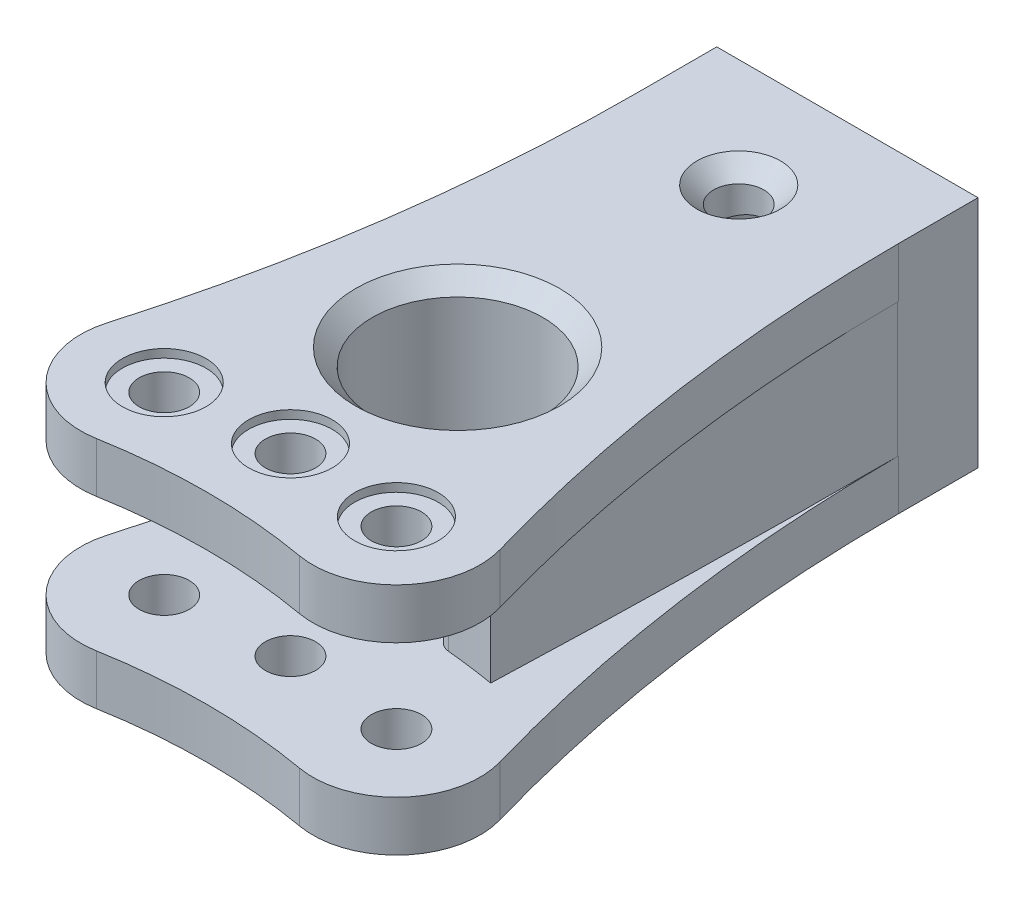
ISO-10303-21;
HEADER;
FILE_DESCRIPTION(('STEP AP214'),'2;1');
FILE_NAME('part.step','',(''),(''),'','','');
FILE_SCHEMA(('AUTOMOTIVE_DESIGN { 1 0 10303 214 1 1 1 1 }'));
ENDSEC;
DATA;
#1=APPLICATION_CONTEXT('core data for automotive mechanical design processes');
#2=APPLICATION_PROTOCOL_DEFINITION('international standard','automotive_design',2000,#1);
#3=PRODUCT_CONTEXT('',#1,'mechanical');
#4=PRODUCT('Part','Part','',(#3));
#5=PRODUCT_RELATED_PRODUCT_CATEGORY('part','',(#4));
#6=PRODUCT_DEFINITION_FORMATION('','',#4);
#7=PRODUCT_DEFINITION_CONTEXT('part definition',#1,'design');
#8=PRODUCT_DEFINITION('design','',#6,#7);
#9=PRODUCT_DEFINITION_SHAPE('','',#8);
#10=(LENGTH_UNIT() NAMED_UNIT(*) SI_UNIT(.MILLI.,.METRE.));
#11=(NAMED_UNIT(*) PLANE_ANGLE_UNIT() SI_UNIT($,.RADIAN.));
#12=(NAMED_UNIT(*) SI_UNIT($,.STERADIAN.) SOLID_ANGLE_UNIT());
#13=UNCERTAINTY_MEASURE_WITH_UNIT(LENGTH_MEASURE(1.E-05),#10,'distance_accuracy_value','');
#14=(GEOMETRIC_REPRESENTATION_CONTEXT(3) GLOBAL_UNCERTAINTY_ASSIGNED_CONTEXT((#13)) GLOBAL_UNIT_ASSIGNED_CONTEXT((#10,
#11,#12)) REPRESENTATION_CONTEXT('',''));
#15=CARTESIAN_POINT('',(0.,0.,0.));
#16=DIRECTION('',(0.,0.,1.));
#17=DIRECTION('',(1.,0.,0.));
#18=AXIS2_PLACEMENT_3D('',#15,#16,#17);
#19=CARTESIAN_POINT('',(6.94592710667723,14.,-39.3923101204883));
#20=DIRECTION('',(0.,-1.,0.));
#21=DIRECTION('',(0.,0.,-1.));
#22=AXIS2_PLACEMENT_3D('',#19,#20,#21);
#23=CYLINDRICAL_SURFACE('',#22,1.5);
#24=CARTESIAN_POINT('',(6.94592710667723,11.,-39.3923101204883));
#25=DIRECTION('',(0.,-1.,0.));
#26=DIRECTION('',(0.,0.,-1.));
#27=AXIS2_PLACEMENT_3D('',#24,#25,#26);
#28=CIRCLE('',#27,1.5);
#29=CARTESIAN_POINT('',(6.94592710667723,11.,-40.8923101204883));
#30=VERTEX_POINT('',#29);
#31=EDGE_CURVE('E592',#30,#30,#28,.T.);
#32=ORIENTED_EDGE('',*,*,#31,.T.);
#33=EDGE_LOOP('',(#32));
#34=FACE_BOUND('',#33,.T.);
#35=CARTESIAN_POINT('',(6.94592710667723,13.5,-39.3923101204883));
#36=DIRECTION('',(0.,1.,0.));
#37=DIRECTION('',(0.,0.,1.));
#38=AXIS2_PLACEMENT_3D('',#35,#36,#37);
#39=CIRCLE('',#38,1.5);
#40=CARTESIAN_POINT('',(6.94592710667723,13.5,-37.8923101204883));
#41=VERTEX_POINT('',#40);
#42=EDGE_CURVE('E526',#41,#41,#39,.T.);
#43=ORIENTED_EDGE('',*,*,#42,.T.);
#44=EDGE_LOOP('',(#43));
#45=FACE_BOUND('',#44,.T.);
#46=ADVANCED_FACE('F51',(#34,#45),#23,.F.);
#47=CARTESIAN_POINT('',(-6.94592710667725,14.,-39.3923101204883));
#48=DIRECTION('',(0.,-1.,0.));
#49=DIRECTION('',(0.,0.,-1.));
#50=AXIS2_PLACEMENT_3D('',#47,#48,#49);
#51=CYLINDRICAL_SURFACE('',#50,1.5);
#52=CARTESIAN_POINT('',(-6.94592710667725,11.,-39.3923101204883));
#53=DIRECTION('',(0.,-1.,0.));
#54=DIRECTION('',(0.,0.,-1.));
#55=AXIS2_PLACEMENT_3D('',#52,#53,#54);
#56=CIRCLE('',#55,1.5);
#57=CARTESIAN_POINT('',(-6.94592710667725,11.,-40.8923101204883));
#58=VERTEX_POINT('',#57);
#59=EDGE_CURVE('E588',#58,#58,#56,.T.);
#60=ORIENTED_EDGE('',*,*,#59,.T.);
#61=EDGE_LOOP('',(#60));
#62=FACE_BOUND('',#61,.T.);
#63=CARTESIAN_POINT('',(-6.94592710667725,13.5,-39.3923101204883));
#64=DIRECTION('',(0.,1.,0.));
#65=DIRECTION('',(0.,0.,1.));
#66=AXIS2_PLACEMENT_3D('',#63,#64,#65);
#67=CIRCLE('',#66,1.5);
#68=CARTESIAN_POINT('',(-6.94592710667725,13.5,-37.8923101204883));
#69=VERTEX_POINT('',#68);
#70=EDGE_CURVE('E846',#69,#69,#67,.T.);
#71=ORIENTED_EDGE('',*,*,#70,.T.);
#72=EDGE_LOOP('',(#71));
#73=FACE_BOUND('',#72,.T.);
#74=ADVANCED_FACE('F435',(#62,#73),#51,.F.);
#75=CARTESIAN_POINT('',(0.,14.,-40.));
#76=DIRECTION('',(0.,-1.,0.));
#77=DIRECTION('',(0.,0.,-1.));
#78=AXIS2_PLACEMENT_3D('',#75,#76,#77);
#79=CYLINDRICAL_SURFACE('',#78,1.5);
#80=CARTESIAN_POINT('',(0.,11.,-40.));
#81=DIRECTION('',(0.,-1.,0.));
#82=DIRECTION('',(0.,0.,-1.));
#83=AXIS2_PLACEMENT_3D('',#80,#81,#82);
#84=CIRCLE('',#83,1.5);
#85=CARTESIAN_POINT('',(0.,11.,-41.5));
#86=VERTEX_POINT('',#85);
#87=EDGE_CURVE('E587',#86,#86,#84,.T.);
#88=ORIENTED_EDGE('',*,*,#87,.T.);
#89=EDGE_LOOP('',(#88));
#90=FACE_BOUND('',#89,.T.);
#91=CARTESIAN_POINT('',(0.,13.5,-40.));
#92=DIRECTION('',(0.,1.,0.));
#93=DIRECTION('',(0.,0.,1.));
#94=AXIS2_PLACEMENT_3D('',#91,#92,#93);
#95=CIRCLE('',#94,1.5);
#96=CARTESIAN_POINT('',(0.,13.5,-38.5));
#97=VERTEX_POINT('',#96);
#98=EDGE_CURVE('E503',#97,#97,#95,.T.);
#99=ORIENTED_EDGE('',*,*,#98,.T.);
#100=EDGE_LOOP('',(#99));
#101=FACE_BOUND('',#100,.T.);
#102=ADVANCED_FACE('F438',(#90,#101),#79,.F.);
#103=CARTESIAN_POINT('',(6.94592710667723,3.,-39.3923101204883));
#104=DIRECTION('',(0.,-1.,0.));
#105=DIRECTION('',(0.,0.,-1.));
#106=AXIS2_PLACEMENT_3D('',#103,#104,#105);
#107=CIRCLE('',#106,1.5);
#108=CARTESIAN_POINT('',(6.94592710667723,3.,-40.8923101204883));
#109=VERTEX_POINT('',#108);
#110=EDGE_CURVE('E579',#109,#109,#107,.T.);
#111=ORIENTED_EDGE('',*,*,#110,.F.);
#112=EDGE_LOOP('',(#111));
#113=FACE_BOUND('',#112,.T.);
#114=CARTESIAN_POINT('',(6.94592710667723,0.5,-39.3923101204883));
#115=DIRECTION('',(0.,-1.,0.));
#116=DIRECTION('',(0.,0.,-1.));
#117=AXIS2_PLACEMENT_3D('',#114,#115,#116);
#118=CIRCLE('',#117,1.5);
#119=CARTESIAN_POINT('',(6.94592710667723,0.5,-40.8923101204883));
#120=VERTEX_POINT('',#119);
#121=EDGE_CURVE('E877',#120,#120,#118,.T.);
#122=ORIENTED_EDGE('',*,*,#121,.T.);
#123=EDGE_LOOP('',(#122));
#124=FACE_BOUND('',#123,.T.);
#125=ADVANCED_FACE('F433',(#113,#124),#23,.F.);
#126=CARTESIAN_POINT('',(-6.94592710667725,3.,-39.3923101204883));
#127=DIRECTION('',(0.,-1.,0.));
#128=DIRECTION('',(0.,0.,-1.));
#129=AXIS2_PLACEMENT_3D('',#126,#127,#128);
#130=CIRCLE('',#129,1.5);
#131=CARTESIAN_POINT('',(-6.94592710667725,3.,-40.8923101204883));
#132=VERTEX_POINT('',#131);
#133=EDGE_CURVE('E575',#132,#132,#130,.T.);
#134=ORIENTED_EDGE('',*,*,#133,.F.);
#135=EDGE_LOOP('',(#134));
#136=FACE_BOUND('',#135,.T.);
#137=CARTESIAN_POINT('',(-6.94592710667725,0.5,-39.3923101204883));
#138=DIRECTION('',(0.,-1.,0.));
#139=DIRECTION('',(0.,0.,-1.));
#140=AXIS2_PLACEMENT_3D('',#137,#138,#139);
#141=CIRCLE('',#140,1.5);
#142=CARTESIAN_POINT('',(-6.94592710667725,0.5,-40.8923101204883));
#143=VERTEX_POINT('',#142);
#144=EDGE_CURVE('E873',#143,#143,#141,.T.);
#145=ORIENTED_EDGE('',*,*,#144,.T.);
#146=EDGE_LOOP('',(#145));
#147=FACE_BOUND('',#146,.T.);
#148=ADVANCED_FACE('F430',(#136,#147),#51,.F.);
#149=CARTESIAN_POINT('',(0.,3.,-40.));
#150=DIRECTION('',(0.,-1.,0.));
#151=DIRECTION('',(0.,0.,-1.));
#152=AXIS2_PLACEMENT_3D('',#149,#150,#151);
#153=CIRCLE('',#152,1.5);
#154=CARTESIAN_POINT('',(0.,3.,-41.5));
#155=VERTEX_POINT('',#154);
#156=EDGE_CURVE('E569',#155,#155,#153,.T.);
#157=ORIENTED_EDGE('',*,*,#156,.F.);
#158=EDGE_LOOP('',(#157));
#159=FACE_BOUND('',#158,.T.);
#160=CARTESIAN_POINT('',(0.,0.5,-40.));
#161=DIRECTION('',(0.,-1.,0.));
#162=DIRECTION('',(0.,0.,-1.));
#163=AXIS2_PLACEMENT_3D('',#160,#161,#162);
#164=CIRCLE('',#163,1.5);
#165=CARTESIAN_POINT('',(0.,0.5,-41.5));
#166=VERTEX_POINT('',#165);
#167=EDGE_CURVE('E511',#166,#166,#164,.T.);
#168=ORIENTED_EDGE('',*,*,#167,.T.);
#169=EDGE_LOOP('',(#168));
#170=FACE_BOUND('',#169,.T.);
#171=ADVANCED_FACE('F351',(#159,#170),#79,.F.);
#172=CARTESIAN_POINT('',(-662.185832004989,11.,-68.4884223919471));
#173=DIRECTION('',(0.,-1.,0.));
#174=DIRECTION('',(0.,0.,-1.));
#175=AXIS2_PLACEMENT_3D('',#172,#173,#174);
#176=CYLINDRICAL_SURFACE('',#175,670.);
#177=CARTESIAN_POINT('',(-662.185832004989,11.,-68.4884223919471));
#178=DIRECTION('',(0.,-1.,0.));
#179=DIRECTION('',(0.,0.,-1.));
#180=AXIS2_PLACEMENT_3D('',#177,#178,#179);
#181=CIRCLE('',#180,670.);
#182=CARTESIAN_POINT('',(7.3878889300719,11.,-44.5921416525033));
#183=VERTEX_POINT('',#182);
#184=CARTESIAN_POINT('',(7.81416799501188,11.,-68.4884223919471));
#185=VERTEX_POINT('',#184);
#186=EDGE_CURVE('E777',#183,#185,#181,.F.);
#187=ORIENTED_EDGE('',*,*,#186,.F.);
#188=DIRECTION('',(0.,1.,0.));
#189=VECTOR('',#188,1.);
#190=CARTESIAN_POINT('',(7.38788893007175,7.,-44.5921416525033));
#191=LINE('',#190,#189);
#192=CARTESIAN_POINT('',(7.3878889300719,3.,-44.5921416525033));
#193=VERTEX_POINT('',#192);
#194=EDGE_CURVE('E541',#183,#193,#191,.F.);
#195=ORIENTED_EDGE('',*,*,#194,.T.);
#196=CARTESIAN_POINT('',(-662.185832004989,3.,-68.4884223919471));
#197=DIRECTION('',(0.,-1.,0.));
#198=DIRECTION('',(0.,0.,-1.));
#199=AXIS2_PLACEMENT_3D('',#196,#197,#198);
#200=CIRCLE('',#199,670.);
#201=CARTESIAN_POINT('',(7.81416799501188,3.,-68.4884223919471));
#202=VERTEX_POINT('',#201);
#203=EDGE_CURVE('E773',#202,#193,#200,.T.);
#204=ORIENTED_EDGE('',*,*,#203,.F.);
#205=DIRECTION('',(0.,-1.,0.));
#206=VECTOR('',#205,1.);
#207=CARTESIAN_POINT('',(7.81416799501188,14.,-68.4884223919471));
#208=LINE('',#207,#206);
#209=EDGE_CURVE('E752',#185,#202,#208,.T.);
#210=ORIENTED_EDGE('',*,*,#209,.F.);
#211=EDGE_LOOP('',(#187,#195,#204,#210));
#212=FACE_BOUND('',#211,.T.);
#213=ADVANCED_FACE('F347',(#212),#176,.T.);
#214=CARTESIAN_POINT('',(662.185832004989,11.,-68.4884223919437));
#215=DIRECTION('',(0.,-1.,0.));
#216=DIRECTION('',(0.,0.,-1.));
#217=AXIS2_PLACEMENT_3D('',#214,#215,#216);
#218=CYLINDRICAL_SURFACE('',#217,670.);
#219=CARTESIAN_POINT('',(662.185832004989,3.,-68.4884223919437));
#220=DIRECTION('',(0.,-1.,0.));
#221=DIRECTION('',(0.,0.,-1.));
#222=AXIS2_PLACEMENT_3D('',#219,#220,#221);
#223=CIRCLE('',#222,670.);
#224=CARTESIAN_POINT('',(-7.387888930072,3.,-44.5921416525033));
#225=VERTEX_POINT('',#224);
#226=CARTESIAN_POINT('',(-7.81416799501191,3.,-68.4884223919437));
#227=VERTEX_POINT('',#226);
#228=EDGE_CURVE('E780',#225,#227,#223,.T.);
#229=ORIENTED_EDGE('',*,*,#228,.F.);
#230=DIRECTION('',(0.,1.,0.));
#231=VECTOR('',#230,1.);
#232=CARTESIAN_POINT('',(-7.38788893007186,7.,-44.5921416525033));
#233=LINE('',#232,#231);
#234=CARTESIAN_POINT('',(-7.387888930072,11.,-44.5921416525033));
#235=VERTEX_POINT('',#234);
#236=EDGE_CURVE('E981',#225,#235,#233,.T.);
#237=ORIENTED_EDGE('',*,*,#236,.T.);
#238=CARTESIAN_POINT('',(662.185832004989,11.,-68.4884223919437));
#239=DIRECTION('',(0.,-1.,0.));
#240=DIRECTION('',(0.,0.,-1.));
#241=AXIS2_PLACEMENT_3D('',#238,#239,#240);
#242=CIRCLE('',#241,670.);
#243=CARTESIAN_POINT('',(-7.81416799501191,11.,-68.4884223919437));
#244=VERTEX_POINT('',#243);
#245=EDGE_CURVE('E783',#244,#235,#242,.F.);
#246=ORIENTED_EDGE('',*,*,#245,.F.);
#247=DIRECTION('',(0.,1.,0.));
#248=VECTOR('',#247,1.);
#249=CARTESIAN_POINT('',(-7.81416799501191,11.,-68.4884223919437));
#250=LINE('',#249,#248);
#251=EDGE_CURVE('E770',#227,#244,#250,.T.);
#252=ORIENTED_EDGE('',*,*,#251,.F.);
#253=EDGE_LOOP('',(#229,#237,#246,#252));
#254=FACE_BOUND('',#253,.T.);
#255=ADVANCED_FACE('F343',(#254),#218,.T.);
#256=CARTESIAN_POINT('',(0.,-1.00000000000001,-66.8163488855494));
#257=DIRECTION('',(0.,1.,0.));
#258=DIRECTION('',(0.,0.,1.));
#259=AXIS2_PLACEMENT_3D('',#256,#257,#258);
#260=CYLINDRICAL_SURFACE('',#259,1.5);
#261=CARTESIAN_POINT('',(0.,2.5,-65.3163488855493));
#262=CARTESIAN_POINT('',(-0.0818450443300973,2.49999977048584,-65.3163485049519));
#263=CARTESIAN_POINT('',(-0.163687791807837,2.50225345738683,-65.3230692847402));
#264=CARTESIAN_POINT('',(-0.324962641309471,2.51102184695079,-65.3496925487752));
#265=CARTESIAN_POINT('',(-0.40439449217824,2.51753699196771,-65.3695964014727));
#266=CARTESIAN_POINT('',(-0.558499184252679,2.53412038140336,-65.4218277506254));
#267=CARTESIAN_POINT('',(-0.633179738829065,2.5441826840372,-65.4541344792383));
#268=CARTESIAN_POINT('',(-0.776062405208,2.56683331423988,-65.5301606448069));
#269=CARTESIAN_POINT('',(-0.844263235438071,2.57942213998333,-65.5738823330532));
#270=CARTESIAN_POINT('',(-0.974612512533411,2.60628858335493,-65.6730875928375));
#271=CARTESIAN_POINT('',(-1.03650555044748,2.62060665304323,-65.7288957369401));
#272=CARTESIAN_POINT('',(-1.15024903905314,2.64909527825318,-65.8499996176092));
#273=CARTESIAN_POINT('',(-1.2020972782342,2.66326580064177,-65.9152974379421));
#274=CARTESIAN_POINT('',(-1.2957374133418,2.6903000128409,-66.0558265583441));
#275=CARTESIAN_POINT('',(-1.33719728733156,2.70311441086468,-66.1312894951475));
#276=CARTESIAN_POINT('',(-1.4067283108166,2.72537041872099,-66.2886130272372));
#277=CARTESIAN_POINT('',(-1.43480354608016,2.73481305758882,-66.3704716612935));
#278=CARTESIAN_POINT('',(-1.47581019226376,2.74883045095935,-66.5353587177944));
#279=CARTESIAN_POINT('',(-1.48922017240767,2.75355856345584,-66.618254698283));
#280=CARTESIAN_POINT('',(-1.50201168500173,2.75806515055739,-66.7852445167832));
#281=CARTESIAN_POINT('',(-1.50139755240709,2.75784515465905,-66.8693379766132));
#282=CARTESIAN_POINT('',(-1.48652985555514,2.7526147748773,-67.0322538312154));
#283=CARTESIAN_POINT('',(-1.47290086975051,2.74782376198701,-67.1111414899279));
#284=CARTESIAN_POINT('',(-1.43340924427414,2.73435013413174,-67.2654390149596));
#285=CARTESIAN_POINT('',(-1.40754513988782,2.72566705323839,-67.340848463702));
#286=CARTESIAN_POINT('',(-1.34390858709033,2.70523133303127,-67.4874680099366));
#287=CARTESIAN_POINT('',(-1.30595107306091,2.69343151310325,-67.5585909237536));
#288=CARTESIAN_POINT('',(-1.21933365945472,2.66811162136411,-67.6936552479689));
#289=CARTESIAN_POINT('',(-1.17067066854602,2.65459105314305,-67.7575945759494));
#290=CARTESIAN_POINT('',(-1.06102399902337,2.62649006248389,-67.8799862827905));
#291=CARTESIAN_POINT('',(-0.999529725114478,2.61189115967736,-67.937977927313));
#292=CARTESIAN_POINT('',(-0.867509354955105,2.58389592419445,-68.0429457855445));
#293=CARTESIAN_POINT('',(-0.796982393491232,2.57049970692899,-68.0899209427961));
#294=CARTESIAN_POINT('',(-0.647921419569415,2.5462433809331,-68.171893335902));
#295=CARTESIAN_POINT('',(-0.569314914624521,2.53540974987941,-68.2067671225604));
#296=CARTESIAN_POINT('',(-0.40690362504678,2.51769149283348,-68.2626536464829));
#297=CARTESIAN_POINT('',(-0.323100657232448,2.51080549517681,-68.2836711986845));
#298=CARTESIAN_POINT('',(-0.156575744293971,2.5019855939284,-68.3104323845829));
#299=CARTESIAN_POINT('',(-0.0739643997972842,2.49984997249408,-68.3167985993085));
#300=CARTESIAN_POINT('',(0.0911626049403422,2.50016645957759,-68.3158498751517));
#301=CARTESIAN_POINT('',(0.173678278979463,2.50261779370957,-68.3085372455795));
#302=CARTESIAN_POINT('',(0.333779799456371,2.51169962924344,-68.2809310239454));
#303=CARTESIAN_POINT('',(0.411439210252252,2.51820701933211,-68.2610195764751));
#304=CARTESIAN_POINT('',(0.562283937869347,2.53462229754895,-68.2092587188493));
#305=CARTESIAN_POINT('',(0.635468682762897,2.54453061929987,-68.1774077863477));
#306=CARTESIAN_POINT('',(0.777432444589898,2.56706603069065,-68.1017432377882));
#307=CARTESIAN_POINT('',(0.84604493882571,2.57975777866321,-68.0576369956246));
#308=CARTESIAN_POINT('',(0.975097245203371,2.60642119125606,-67.9590576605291));
#309=CARTESIAN_POINT('',(1.03553455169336,2.62039324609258,-67.9045814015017));
#310=CARTESIAN_POINT('',(1.14937876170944,2.64884728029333,-67.7838807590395));
#311=CARTESIAN_POINT('',(1.20234145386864,2.66332358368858,-67.7172350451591));
#312=CARTESIAN_POINT('',(1.29638628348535,2.69050040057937,-67.575691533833));
#313=CARTESIAN_POINT('',(1.33746832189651,2.70320089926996,-67.5007936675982));
#314=CARTESIAN_POINT('',(1.40639539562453,2.72526412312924,-67.3448393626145));
#315=CARTESIAN_POINT('',(1.43426719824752,2.73463358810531,-67.2637957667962));
#316=CARTESIAN_POINT('',(1.47584200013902,2.74883751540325,-67.0977809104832));
#317=CARTESIAN_POINT('',(1.4895513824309,2.75367402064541,-67.0128114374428));
#318=CARTESIAN_POINT('',(1.501914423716,2.75803211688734,-66.846053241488));
#319=CARTESIAN_POINT('',(1.50130538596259,2.75781399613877,-66.7643253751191));
#320=CARTESIAN_POINT('',(1.48686344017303,2.75273095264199,-66.6022012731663));
#321=CARTESIAN_POINT('',(1.47303131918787,2.74786630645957,-66.5218049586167));
#322=CARTESIAN_POINT('',(1.433057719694,2.73423213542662,-66.3661453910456));
#323=CARTESIAN_POINT('',(1.40715501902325,2.72553852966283,-66.2908136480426));
#324=CARTESIAN_POINT('',(1.3439690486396,2.70525401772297,-66.1455077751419));
#325=CARTESIAN_POINT('',(1.30668325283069,2.6936624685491,-66.0755348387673));
#326=CARTESIAN_POINT('',(1.21989103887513,2.6682575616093,-65.939623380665));
#327=CARTESIAN_POINT('',(1.16992236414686,2.65436932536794,-65.8739941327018));
#328=CARTESIAN_POINT('',(1.05996432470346,2.6262496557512,-65.7518141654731));
#329=CARTESIAN_POINT('',(0.999972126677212,2.61201812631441,-65.6952660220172));
#330=CARTESIAN_POINT('',(0.868862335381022,2.58414954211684,-65.5906322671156));
#331=CARTESIAN_POINT('',(0.79740227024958,2.57055727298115,-65.5429623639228));
#332=CARTESIAN_POINT('',(0.647036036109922,2.54611013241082,-65.4603632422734));
#333=CARTESIAN_POINT('',(0.568131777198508,2.53525456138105,-65.4254307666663));
#334=CARTESIAN_POINT('',(0.40874047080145,2.51791727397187,-65.3707664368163));
#335=CARTESIAN_POINT('',(0.3284816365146,2.51126181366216,-65.3504251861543));
#336=CARTESIAN_POINT('',(0.165480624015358,2.50230389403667,-65.3232184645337));
#337=CARTESIAN_POINT('',(0.0827391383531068,2.50000023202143,-65.3163492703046));
#338=CARTESIAN_POINT('',(0.,2.5,-65.3163488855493));
#339=B_SPLINE_CURVE_WITH_KNOTS('',3,(#261,#262,#263,#264,#265,#266,#267,#268,#269,#270,#271,
#272,#273,#274,#275,#276,#277,#278,#279,#280,#281,#282,#283,#284,#285,#286,#287,#288,#289,#290,
#291,#292,#293,#294,#295,#296,#297,#298,#299,#300,#301,#302,#303,#304,#305,#306,#307,#308,#309,
#310,#311,#312,#313,#314,#315,#316,#317,#318,#319,#320,#321,#322,#323,#324,#325,#326,#327,#328,
#329,#330,#331,#332,#333,#334,#335,#336,#337,#338),.UNSPECIFIED.,.T.,.F.,(4,2,2,2,2,2,2,2,2,2,2,
2,2,2,2,2,2,2,2,2,2,2,2,2,2,2,2,2,2,2,2,2,2,2,2,2,2,2,4),(0.,0.245230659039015,
0.490486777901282,0.735334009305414,0.980229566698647,1.23277026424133,1.48536649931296,
1.74522577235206,2.0050056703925,2.25602888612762,2.50697450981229,2.74645239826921,
2.98595896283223,3.22932256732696,3.47275653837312,3.72889958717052,3.98506718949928,
4.24377608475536,4.50239503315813,4.74980374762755,4.99717069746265,5.23737236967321,
5.47760467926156,5.72415599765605,5.97078271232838,6.22861534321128,6.48645012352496,
6.74376020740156,7.00095427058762,7.24493499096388,7.48890119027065,7.72823380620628,
7.96761957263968,8.21745100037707,8.46735316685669,8.72699491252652,8.98657021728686,
9.23454837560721,9.4824579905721),.UNSPECIFIED.);
#340=CARTESIAN_POINT('',(0.,2.5,-65.3163488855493));
#341=VERTEX_POINT('',#340);
#342=EDGE_CURVE('E757',#341,#341,#339,.T.);
#343=ORIENTED_EDGE('',*,*,#342,.F.);
#344=EDGE_LOOP('',(#343));
#345=FACE_BOUND('',#344,.T.);
#346=CARTESIAN_POINT('',(0.,1.5,-66.8163488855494));
#347=DIRECTION('',(0.,-1.,0.));
#348=DIRECTION('',(0.,0.,-1.));
#349=AXIS2_PLACEMENT_3D('',#346,#347,#348);
#350=CIRCLE('',#349,1.5);
#351=CARTESIAN_POINT('',(0.,1.5,-68.3163488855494));
#352=VERTEX_POINT('',#351);
#353=EDGE_CURVE('E550',#352,#352,#350,.F.);
#354=ORIENTED_EDGE('',*,*,#353,.F.);
#355=EDGE_LOOP('',(#354));
#356=FACE_BOUND('',#355,.T.);
#357=ADVANCED_FACE('F346',(#345,#356),#260,.F.);
#358=CARTESIAN_POINT('',(6.94592710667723,14.,-39.3923101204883));
#359=DIRECTION('',(0.,-1.,0.));
#360=DIRECTION('',(0.,0.,-1.));
#361=AXIS2_PLACEMENT_3D('',#358,#359,#360);
#362=CYLINDRICAL_SURFACE('',#361,5.);
#363=CARTESIAN_POINT('',(6.94592710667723,11.,-39.3923101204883));
#364=DIRECTION('',(0.,-1.,0.));
#365=DIRECTION('',(0.,0.,-1.));
#366=AXIS2_PLACEMENT_3D('',#363,#364,#365);
#367=CIRCLE('',#366,5.);
#368=CARTESIAN_POINT('',(11.7491766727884,11.,-40.7811202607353));
#369=VERTEX_POINT('',#368);
#370=CARTESIAN_POINT('',(6.07768621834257,11.,-34.4682713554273));
#371=VERTEX_POINT('',#370);
#372=EDGE_CURVE('E596',#369,#371,#367,.T.);
#373=ORIENTED_EDGE('',*,*,#372,.F.);
#374=DIRECTION('',(0.,-1.,0.));
#375=VECTOR('',#374,1.);
#376=CARTESIAN_POINT('',(11.7491766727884,14.,-40.7811202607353));
#377=LINE('',#376,#375);
#378=CARTESIAN_POINT('',(11.7491766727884,14.,-40.7811202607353));
#379=VERTEX_POINT('',#378);
#380=EDGE_CURVE('E676',#369,#379,#377,.F.);
#381=ORIENTED_EDGE('',*,*,#380,.T.);
#382=CARTESIAN_POINT('',(6.94592710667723,14.,-39.3923101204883));
#383=DIRECTION('',(0.,1.,0.));
#384=DIRECTION('',(0.,0.,1.));
#385=AXIS2_PLACEMENT_3D('',#382,#383,#384);
#386=CIRCLE('',#385,5.);
#387=CARTESIAN_POINT('',(6.07768621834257,14.,-34.4682713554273));
#388=VERTEX_POINT('',#387);
#389=EDGE_CURVE('E600',#388,#379,#386,.T.);
#390=ORIENTED_EDGE('',*,*,#389,.F.);
#391=DIRECTION('',(0.,-1.,0.));
#392=VECTOR('',#391,1.);
#393=CARTESIAN_POINT('',(6.07768621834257,14.,-34.4682713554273));
#394=LINE('',#393,#392);
#395=EDGE_CURVE('E642',#388,#371,#394,.T.);
#396=ORIENTED_EDGE('',*,*,#395,.T.);
#397=EDGE_LOOP('',(#373,#381,#390,#396));
#398=FACE_BOUND('',#397,.T.);
#399=ADVANCED_FACE('F410',(#398),#362,.T.);
#400=CARTESIAN_POINT('',(-6.94592710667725,14.,-39.3923101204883));
#401=DIRECTION('',(0.,-1.,0.));
#402=DIRECTION('',(0.,0.,-1.));
#403=AXIS2_PLACEMENT_3D('',#400,#401,#402);
#404=CYLINDRICAL_SURFACE('',#403,5.);
#405=CARTESIAN_POINT('',(-6.94592710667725,14.,-39.3923101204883));
#406=DIRECTION('',(0.,1.,0.));
#407=DIRECTION('',(0.,0.,1.));
#408=AXIS2_PLACEMENT_3D('',#405,#406,#407);
#409=CIRCLE('',#408,5.);
#410=CARTESIAN_POINT('',(-11.7491766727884,14.,-40.7811202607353));
#411=VERTEX_POINT('',#410);
#412=CARTESIAN_POINT('',(-6.07768621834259,14.,-34.4682713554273));
#413=VERTEX_POINT('',#412);
#414=EDGE_CURVE('E613',#411,#413,#409,.T.);
#415=ORIENTED_EDGE('',*,*,#414,.F.);
#416=DIRECTION('',(0.,-1.,0.));
#417=VECTOR('',#416,1.);
#418=CARTESIAN_POINT('',(-11.7491766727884,14.,-40.7811202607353));
#419=LINE('',#418,#417);
#420=CARTESIAN_POINT('',(-11.7491766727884,11.,-40.7811202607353));
#421=VERTEX_POINT('',#420);
#422=EDGE_CURVE('E698',#411,#421,#419,.T.);
#423=ORIENTED_EDGE('',*,*,#422,.T.);
#424=CARTESIAN_POINT('',(-6.94592710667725,11.,-39.3923101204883));
#425=DIRECTION('',(0.,-1.,0.));
#426=DIRECTION('',(0.,0.,-1.));
#427=AXIS2_PLACEMENT_3D('',#424,#425,#426);
#428=CIRCLE('',#427,5.);
#429=CARTESIAN_POINT('',(-6.07768621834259,11.,-34.4682713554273));
#430=VERTEX_POINT('',#429);
#431=EDGE_CURVE('E564',#430,#421,#428,.T.);
#432=ORIENTED_EDGE('',*,*,#431,.F.);
#433=DIRECTION('',(0.,-1.,0.));
#434=VECTOR('',#433,1.);
#435=CARTESIAN_POINT('',(-6.07768621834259,14.,-34.4682713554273));
#436=LINE('',#435,#434);
#437=EDGE_CURVE('E647',#413,#430,#436,.T.);
#438=ORIENTED_EDGE('',*,*,#437,.F.);
#439=EDGE_LOOP('',(#415,#423,#432,#438));
#440=FACE_BOUND('',#439,.T.);
#441=ADVANCED_FACE('F426',(#440),#404,.T.);
#442=CARTESIAN_POINT('',(0.,14.,0.));
#443=DIRECTION('',(0.,-1.,0.));
#444=DIRECTION('',(0.,0.,-1.));
#445=AXIS2_PLACEMENT_3D('',#442,#443,#444);
#446=CYLINDRICAL_SURFACE('',#445,35.);
#447=ORIENTED_EDGE('',*,*,#437,.T.);
#448=CARTESIAN_POINT('',(0.,11.,0.));
#449=DIRECTION('',(0.,-1.,0.));
#450=DIRECTION('',(0.,0.,-1.));
#451=AXIS2_PLACEMENT_3D('',#448,#449,#450);
#452=CIRCLE('',#451,35.);
#453=EDGE_CURVE('E560',#430,#371,#452,.T.);
#454=ORIENTED_EDGE('',*,*,#453,.T.);
#455=ORIENTED_EDGE('',*,*,#395,.F.);
#456=CARTESIAN_POINT('',(0.,14.,0.));
#457=DIRECTION('',(0.,1.,0.));
#458=DIRECTION('',(0.,0.,1.));
#459=AXIS2_PLACEMENT_3D('',#456,#457,#458);
#460=CIRCLE('',#459,35.);
#461=EDGE_CURVE('E616',#388,#413,#460,.T.);
#462=ORIENTED_EDGE('',*,*,#461,.T.);
#463=EDGE_LOOP('',(#447,#454,#455,#462));
#464=FACE_BOUND('',#463,.T.);
#465=ADVANCED_FACE('F408',(#464),#446,.F.);
#466=CARTESIAN_POINT('',(6.94592710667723,0.,-39.3923101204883));
#467=DIRECTION('',(0.,1.,0.));
#468=DIRECTION('',(0.,0.,1.));
#469=AXIS2_PLACEMENT_3D('',#466,#467,#468);
#470=CIRCLE('',#469,5.);
#471=CARTESIAN_POINT('',(6.07768621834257,0.,-34.4682713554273));
#472=VERTEX_POINT('',#471);
#473=CARTESIAN_POINT('',(11.7491766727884,0.,-40.7811202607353));
#474=VERTEX_POINT('',#473);
#475=EDGE_CURVE('E624',#472,#474,#470,.T.);
#476=ORIENTED_EDGE('',*,*,#475,.T.);
#477=DIRECTION('',(0.,-1.,0.));
#478=VECTOR('',#477,1.);
#479=CARTESIAN_POINT('',(11.7491766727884,14.,-40.7811202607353));
#480=LINE('',#479,#478);
#481=CARTESIAN_POINT('',(11.7491766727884,3.,-40.7811202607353));
#482=VERTEX_POINT('',#481);
#483=EDGE_CURVE('E673',#474,#482,#480,.F.);
#484=ORIENTED_EDGE('',*,*,#483,.T.);
#485=CARTESIAN_POINT('',(6.94592710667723,3.,-39.3923101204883));
#486=DIRECTION('',(0.,-1.,0.));
#487=DIRECTION('',(0.,0.,-1.));
#488=AXIS2_PLACEMENT_3D('',#485,#486,#487);
#489=CIRCLE('',#488,5.);
#490=CARTESIAN_POINT('',(6.07768621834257,3.,-34.4682713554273));
#491=VERTEX_POINT('',#490);
#492=EDGE_CURVE('E565',#482,#491,#489,.T.);
#493=ORIENTED_EDGE('',*,*,#492,.T.);
#494=EDGE_CURVE('E620',#491,#472,#394,.T.);
#495=ORIENTED_EDGE('',*,*,#494,.T.);
#496=EDGE_LOOP('',(#476,#484,#493,#495));
#497=FACE_BOUND('',#496,.T.);
#498=ADVANCED_FACE('F404',(#497),#362,.T.);
#499=CARTESIAN_POINT('',(7.81416799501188,14.,0.));
#500=DIRECTION('',(-1.,0.,0.));
#501=DIRECTION('',(0.,0.,1.));
#502=AXIS2_PLACEMENT_3D('',#499,#500,#501);
#503=PLANE('',#502);
#504=DIRECTION('',(0.,0.,1.));
#505=VECTOR('',#504,1.);
#506=CARTESIAN_POINT('',(7.81416799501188,11.,0.));
#507=LINE('',#506,#505);
#508=CARTESIAN_POINT('',(7.81416799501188,11.,-68.5573230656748));
#509=VERTEX_POINT('',#508);
#510=EDGE_CURVE('E651',#509,#185,#507,.T.);
#511=ORIENTED_EDGE('',*,*,#510,.T.);
#512=ORIENTED_EDGE('',*,*,#209,.T.);
#513=DIRECTION('',(0.,0.,-1.));
#514=VECTOR('',#513,1.);
#515=CARTESIAN_POINT('',(7.81416799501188,3.,0.));
#516=LINE('',#515,#514);
#517=CARTESIAN_POINT('',(7.81416799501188,3.,-68.5573230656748));
#518=VERTEX_POINT('',#517);
#519=EDGE_CURVE('E665',#202,#518,#516,.T.);
#520=ORIENTED_EDGE('',*,*,#519,.T.);
#521=DIRECTION('',(0.,1.,0.));
#522=VECTOR('',#521,1.);
#523=CARTESIAN_POINT('',(7.81416799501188,0.,-68.5573230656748));
#524=LINE('',#523,#522);
#525=CARTESIAN_POINT('',(7.81416799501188,0.,-68.5573230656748));
#526=VERTEX_POINT('',#525);
#527=EDGE_CURVE('E669',#518,#526,#524,.F.);
#528=ORIENTED_EDGE('',*,*,#527,.T.);
#529=DIRECTION('',(0.,0.,-1.));
#530=VECTOR('',#529,1.);
#531=CARTESIAN_POINT('',(7.81416799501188,0.,0.));
#532=LINE('',#531,#530);
#533=CARTESIAN_POINT('',(7.81416799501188,0.,-73.3163488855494));
#534=VERTEX_POINT('',#533);
#535=EDGE_CURVE('E628',#526,#534,#532,.T.);
#536=ORIENTED_EDGE('',*,*,#535,.T.);
#537=DIRECTION('',(0.,1.,0.));
#538=VECTOR('',#537,1.);
#539=CARTESIAN_POINT('',(7.81416799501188,14.,-73.3163488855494));
#540=LINE('',#539,#538);
#541=CARTESIAN_POINT('',(7.81416799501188,14.,-73.3163488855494));
#542=VERTEX_POINT('',#541);
#543=EDGE_CURVE('E746',#534,#542,#540,.T.);
#544=ORIENTED_EDGE('',*,*,#543,.T.);
#545=DIRECTION('',(0.,0.,-1.));
#546=VECTOR('',#545,1.);
#547=CARTESIAN_POINT('',(7.81416799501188,14.,0.));
#548=LINE('',#547,#546);
#549=CARTESIAN_POINT('',(7.81416799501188,14.,-68.5573230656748));
#550=VERTEX_POINT('',#549);
#551=EDGE_CURVE('E604',#550,#542,#548,.T.);
#552=ORIENTED_EDGE('',*,*,#551,.F.);
#553=DIRECTION('',(0.,1.,0.));
#554=VECTOR('',#553,1.);
#555=CARTESIAN_POINT('',(7.81416799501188,11.,-68.5573230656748));
#556=LINE('',#555,#554);
#557=EDGE_CURVE('E661',#550,#509,#556,.F.);
#558=ORIENTED_EDGE('',*,*,#557,.T.);
#559=EDGE_LOOP('',(#511,#512,#520,#528,#536,#544,#552,#558));
#560=FACE_BOUND('',#559,.T.);
#561=ADVANCED_FACE('F407',(#560),#503,.F.);
#562=CARTESIAN_POINT('',(0.,14.,-74.3163488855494));
#563=DIRECTION('',(0.,0.,-1.));
#564=DIRECTION('',(-1.,0.,0.));
#565=AXIS2_PLACEMENT_3D('',#562,#563,#564);
#566=PLANE('',#565);
#567=CARTESIAN_POINT('',(0.,7.,-74.3163488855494));
#568=DIRECTION('',(0.,0.,-1.));
#569=DIRECTION('',(-1.,0.,0.));
#570=AXIS2_PLACEMENT_3D('',#567,#568,#569);
#571=CIRCLE('',#570,5.5);
#572=CARTESIAN_POINT('',(-5.5,7.,-74.3163488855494));
#573=VERTEX_POINT('',#572);
#574=EDGE_CURVE('E799',#573,#573,#571,.F.);
#575=ORIENTED_EDGE('',*,*,#574,.T.);
#576=EDGE_LOOP('',(#575));
#577=FACE_BOUND('',#576,.T.);
#578=DIRECTION('',(0.,-1.,0.));
#579=VECTOR('',#578,1.);
#580=CARTESIAN_POINT('',(6.81416799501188,0.,-74.3163488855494));
#581=LINE('',#580,#579);
#582=CARTESIAN_POINT('',(6.81416799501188,13.,-74.3163488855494));
#583=VERTEX_POINT('',#582);
#584=CARTESIAN_POINT('',(6.81416799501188,1.,-74.3163488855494));
#585=VERTEX_POINT('',#584);
#586=EDGE_CURVE('E733',#583,#585,#581,.T.);
#587=ORIENTED_EDGE('',*,*,#586,.T.);
#588=DIRECTION('',(-1.,0.,0.));
#589=VECTOR('',#588,1.);
#590=CARTESIAN_POINT('',(-7.81416799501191,1.,-74.3163488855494));
#591=LINE('',#590,#589);
#592=CARTESIAN_POINT('',(-6.81416799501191,1.,-74.3163488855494));
#593=VERTEX_POINT('',#592);
#594=EDGE_CURVE('E739',#585,#593,#591,.T.);
#595=ORIENTED_EDGE('',*,*,#594,.T.);
#596=DIRECTION('',(0.,1.,0.));
#597=VECTOR('',#596,1.);
#598=CARTESIAN_POINT('',(-6.81416799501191,14.,-74.3163488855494));
#599=LINE('',#598,#597);
#600=CARTESIAN_POINT('',(-6.81416799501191,13.,-74.3163488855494));
#601=VERTEX_POINT('',#600);
#602=EDGE_CURVE('E736',#593,#601,#599,.T.);
#603=ORIENTED_EDGE('',*,*,#602,.T.);
#604=DIRECTION('',(1.,0.,0.));
#605=VECTOR('',#604,1.);
#606=CARTESIAN_POINT('',(0.,13.,-74.3163488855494));
#607=LINE('',#606,#605);
#608=EDGE_CURVE('E730',#601,#583,#607,.T.);
#609=ORIENTED_EDGE('',*,*,#608,.T.);
#610=EDGE_LOOP('',(#587,#595,#603,#609));
#611=FACE_BOUND('',#610,.T.);
#612=ADVANCED_FACE('F413',(#577,#611),#566,.T.);
#613=CARTESIAN_POINT('',(-7.81416799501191,14.,0.));
#614=DIRECTION('',(-1.,0.,0.));
#615=DIRECTION('',(0.,0.,1.));
#616=AXIS2_PLACEMENT_3D('',#613,#614,#615);
#617=PLANE('',#616);
#618=DIRECTION('',(0.,0.,1.));
#619=VECTOR('',#618,1.);
#620=CARTESIAN_POINT('',(-7.81416799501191,3.,0.));
#621=LINE('',#620,#619);
#622=CARTESIAN_POINT('',(-7.81416799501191,3.,-68.5573230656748));
#623=VERTEX_POINT('',#622);
#624=EDGE_CURVE('E690',#623,#227,#621,.T.);
#625=ORIENTED_EDGE('',*,*,#624,.T.);
#626=ORIENTED_EDGE('',*,*,#251,.T.);
#627=DIRECTION('',(0.,0.,-1.));
#628=VECTOR('',#627,1.);
#629=CARTESIAN_POINT('',(-7.81416799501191,11.,0.));
#630=LINE('',#629,#628);
#631=CARTESIAN_POINT('',(-7.81416799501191,11.,-68.5573230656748));
#632=VERTEX_POINT('',#631);
#633=EDGE_CURVE('E686',#244,#632,#630,.T.);
#634=ORIENTED_EDGE('',*,*,#633,.T.);
#635=DIRECTION('',(0.,-1.,0.));
#636=VECTOR('',#635,1.);
#637=CARTESIAN_POINT('',(-7.81416799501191,14.,-68.5573230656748));
#638=LINE('',#637,#636);
#639=CARTESIAN_POINT('',(-7.81416799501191,14.,-68.5573230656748));
#640=VERTEX_POINT('',#639);
#641=EDGE_CURVE('E683',#632,#640,#638,.F.);
#642=ORIENTED_EDGE('',*,*,#641,.T.);
#643=DIRECTION('',(0.,0.,-1.));
#644=VECTOR('',#643,1.);
#645=CARTESIAN_POINT('',(-7.81416799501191,14.,0.));
#646=LINE('',#645,#644);
#647=CARTESIAN_POINT('',(-7.81416799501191,14.,-73.3163488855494));
#648=VERTEX_POINT('',#647);
#649=EDGE_CURVE('E609',#640,#648,#646,.T.);
#650=ORIENTED_EDGE('',*,*,#649,.T.);
#651=DIRECTION('',(0.,-1.,0.));
#652=VECTOR('',#651,1.);
#653=CARTESIAN_POINT('',(-7.81416799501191,14.,-73.3163488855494));
#654=LINE('',#653,#652);
#655=CARTESIAN_POINT('',(-7.81416799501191,0.,-73.3163488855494));
#656=VERTEX_POINT('',#655);
#657=EDGE_CURVE('E743',#648,#656,#654,.T.);
#658=ORIENTED_EDGE('',*,*,#657,.T.);
#659=DIRECTION('',(0.,0.,-1.));
#660=VECTOR('',#659,1.);
#661=CARTESIAN_POINT('',(-7.81416799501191,0.,0.));
#662=LINE('',#661,#660);
#663=CARTESIAN_POINT('',(-7.81416799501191,0.,-68.5573230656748));
#664=VERTEX_POINT('',#663);
#665=EDGE_CURVE('E632',#664,#656,#662,.T.);
#666=ORIENTED_EDGE('',*,*,#665,.F.);
#667=DIRECTION('',(0.,-1.,0.));
#668=VECTOR('',#667,1.);
#669=CARTESIAN_POINT('',(-7.81416799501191,14.,-68.5573230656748));
#670=LINE('',#669,#668);
#671=EDGE_CURVE('E694',#664,#623,#670,.F.);
#672=ORIENTED_EDGE('',*,*,#671,.T.);
#673=EDGE_LOOP('',(#625,#626,#634,#642,#650,#658,#666,#672));
#674=FACE_BOUND('',#673,.T.);
#675=ADVANCED_FACE('F417',(#674),#617,.T.);
#676=CARTESIAN_POINT('',(-6.94592710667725,3.,-39.3923101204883));
#677=DIRECTION('',(0.,-1.,0.));
#678=DIRECTION('',(0.,0.,-1.));
#679=AXIS2_PLACEMENT_3D('',#676,#677,#678);
#680=CIRCLE('',#679,5.);
#681=CARTESIAN_POINT('',(-6.07768621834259,3.,-34.4682713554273));
#682=VERTEX_POINT('',#681);
#683=CARTESIAN_POINT('',(-11.7491766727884,3.,-40.7811202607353));
#684=VERTEX_POINT('',#683);
#685=EDGE_CURVE('E583',#682,#684,#680,.T.);
#686=ORIENTED_EDGE('',*,*,#685,.T.);
#687=DIRECTION('',(0.,-1.,0.));
#688=VECTOR('',#687,1.);
#689=CARTESIAN_POINT('',(-11.7491766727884,14.,-40.7811202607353));
#690=LINE('',#689,#688);
#691=CARTESIAN_POINT('',(-11.7491766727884,0.,-40.7811202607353));
#692=VERTEX_POINT('',#691);
#693=EDGE_CURVE('E679',#684,#692,#690,.T.);
#694=ORIENTED_EDGE('',*,*,#693,.T.);
#695=CARTESIAN_POINT('',(-6.94592710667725,0.,-39.3923101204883));
#696=DIRECTION('',(0.,1.,0.));
#697=DIRECTION('',(0.,0.,1.));
#698=AXIS2_PLACEMENT_3D('',#695,#696,#697);
#699=CIRCLE('',#698,5.);
#700=CARTESIAN_POINT('',(-6.07768621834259,0.,-34.4682713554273));
#701=VERTEX_POINT('',#700);
#702=EDGE_CURVE('E636',#692,#701,#699,.T.);
#703=ORIENTED_EDGE('',*,*,#702,.T.);
#704=EDGE_CURVE('E646',#682,#701,#436,.T.);
#705=ORIENTED_EDGE('',*,*,#704,.F.);
#706=EDGE_LOOP('',(#686,#694,#703,#705));
#707=FACE_BOUND('',#706,.T.);
#708=ADVANCED_FACE('F421',(#707),#404,.T.);
#709=CARTESIAN_POINT('',(0.,3.,0.));
#710=DIRECTION('',(0.,-1.,0.));
#711=DIRECTION('',(0.,0.,-1.));
#712=AXIS2_PLACEMENT_3D('',#709,#710,#711);
#713=CIRCLE('',#712,35.);
#714=EDGE_CURVE('E558',#682,#491,#713,.T.);
#715=ORIENTED_EDGE('',*,*,#714,.F.);
#716=ORIENTED_EDGE('',*,*,#704,.T.);
#717=CARTESIAN_POINT('',(0.,0.,0.));
#718=DIRECTION('',(0.,1.,0.));
#719=DIRECTION('',(0.,0.,1.));
#720=AXIS2_PLACEMENT_3D('',#717,#718,#719);
#721=CIRCLE('',#720,35.);
#722=EDGE_CURVE('E605',#472,#701,#721,.T.);
#723=ORIENTED_EDGE('',*,*,#722,.F.);
#724=ORIENTED_EDGE('',*,*,#494,.F.);
#725=EDGE_LOOP('',(#715,#716,#723,#724));
#726=FACE_BOUND('',#725,.T.);
#727=ADVANCED_FACE('F402',(#726),#446,.F.);
#728=CARTESIAN_POINT('',(0.,14.,-50.));
#729=DIRECTION('',(0.,-1.,0.));
#730=DIRECTION('',(0.,0.,-1.));
#731=AXIS2_PLACEMENT_3D('',#728,#729,#730);
#732=CYLINDRICAL_SURFACE('',#731,5.1);
#733=DIRECTION('',(0.,-1.,0.));
#734=VECTOR('',#733,1.);
#735=CARTESIAN_POINT('',(-3.83020543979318,14.,-46.6325786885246));
#736=LINE('',#735,#734);
#737=CARTESIAN_POINT('',(-3.83020543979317,11.,-46.6325786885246));
#738=VERTEX_POINT('',#737);
#739=CARTESIAN_POINT('',(-3.83020543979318,3.,-46.6325786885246));
#740=VERTEX_POINT('',#739);
#741=EDGE_CURVE('E964',#738,#740,#736,.T.);
#742=ORIENTED_EDGE('',*,*,#741,.T.);
#743=CARTESIAN_POINT('',(0.,3.,-50.));
#744=DIRECTION('',(0.,-1.,0.));
#745=DIRECTION('',(0.,0.,-1.));
#746=AXIS2_PLACEMENT_3D('',#743,#744,#745);
#747=CIRCLE('',#746,5.1);
#748=CARTESIAN_POINT('',(3.83020543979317,3.,-46.6325786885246));
#749=VERTEX_POINT('',#748);
#750=EDGE_CURVE('E538',#749,#740,#747,.T.);
#751=ORIENTED_EDGE('',*,*,#750,.F.);
#752=DIRECTION('',(0.,-1.,0.));
#753=VECTOR('',#752,1.);
#754=CARTESIAN_POINT('',(3.83020543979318,14.,-46.6325786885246));
#755=LINE('',#754,#753);
#756=CARTESIAN_POINT('',(3.83020543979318,11.,-46.6325786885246));
#757=VERTEX_POINT('',#756);
#758=EDGE_CURVE('E977',#749,#757,#755,.F.);
#759=ORIENTED_EDGE('',*,*,#758,.T.);
#760=CARTESIAN_POINT('',(0.,11.,-50.));
#761=DIRECTION('',(0.,-1.,0.));
#762=DIRECTION('',(0.,0.,-1.));
#763=AXIS2_PLACEMENT_3D('',#760,#761,#762);
#764=CIRCLE('',#763,5.1);
#765=EDGE_CURVE('E530',#757,#738,#764,.T.);
#766=ORIENTED_EDGE('',*,*,#765,.T.);
#767=EDGE_LOOP('',(#742,#751,#759,#766));
#768=FACE_BOUND('',#767,.T.);
#769=CARTESIAN_POINT('',(0.,13.,-50.));
#770=DIRECTION('',(0.,1.,0.));
#771=DIRECTION('',(0.,0.,1.));
#772=AXIS2_PLACEMENT_3D('',#769,#770,#771);
#773=CIRCLE('',#772,5.1);
#774=CARTESIAN_POINT('',(0.,13.,-44.9));
#775=VERTEX_POINT('',#774);
#776=EDGE_CURVE('E787',#775,#775,#773,.T.);
#777=ORIENTED_EDGE('',*,*,#776,.T.);
#778=EDGE_LOOP('',(#777));
#779=FACE_BOUND('',#778,.T.);
#780=CARTESIAN_POINT('',(0.,0.,-50.));
#781=DIRECTION('',(0.,1.,0.));
#782=DIRECTION('',(0.,0.,1.));
#783=AXIS2_PLACEMENT_3D('',#780,#781,#782);
#784=CIRCLE('',#783,5.1);
#785=CARTESIAN_POINT('',(0.,0.,-44.9));
#786=VERTEX_POINT('',#785);
#787=EDGE_CURVE('E599',#786,#786,#784,.T.);
#788=ORIENTED_EDGE('',*,*,#787,.F.);
#789=EDGE_LOOP('',(#788));
#790=FACE_BOUND('',#789,.T.);
#791=ADVANCED_FACE('F398',(#768,#779,#790),#732,.F.);
#792=CARTESIAN_POINT('',(0.,14.,0.));
#793=DIRECTION('',(0.,1.,0.));
#794=DIRECTION('',(0.,0.,1.));
#795=AXIS2_PLACEMENT_3D('',#792,#793,#794);
#796=PLANE('',#795);
#797=CARTESIAN_POINT('',(-6.94592710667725,14.,-39.3923101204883));
#798=DIRECTION('',(0.,1.,0.));
#799=DIRECTION('',(0.,0.,1.));
#800=AXIS2_PLACEMENT_3D('',#797,#798,#799);
#801=CIRCLE('',#800,2.5);
#802=CARTESIAN_POINT('',(-6.94592710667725,14.,-36.8923101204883));
#803=VERTEX_POINT('',#802);
#804=EDGE_CURVE('E492',#803,#803,#801,.T.);
#805=ORIENTED_EDGE('',*,*,#804,.F.);
#806=EDGE_LOOP('',(#805));
#807=FACE_BOUND('',#806,.T.);
#808=CARTESIAN_POINT('',(6.94592710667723,14.,-39.3923101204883));
#809=DIRECTION('',(0.,1.,0.));
#810=DIRECTION('',(0.,0.,1.));
#811=AXIS2_PLACEMENT_3D('',#808,#809,#810);
#812=CIRCLE('',#811,2.5);
#813=CARTESIAN_POINT('',(6.94592710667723,14.,-36.8923101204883));
#814=VERTEX_POINT('',#813);
#815=EDGE_CURVE('E483',#814,#814,#812,.T.);
#816=ORIENTED_EDGE('',*,*,#815,.F.);
#817=EDGE_LOOP('',(#816));
#818=FACE_BOUND('',#817,.T.);
#819=CARTESIAN_POINT('',(0.,14.,-40.));
#820=DIRECTION('',(0.,1.,0.));
#821=DIRECTION('',(0.,0.,1.));
#822=AXIS2_PLACEMENT_3D('',#819,#820,#821);
#823=CIRCLE('',#822,2.5);
#824=CARTESIAN_POINT('',(0.,14.,-37.5));
#825=VERTEX_POINT('',#824);
#826=EDGE_CURVE('E487',#825,#825,#823,.T.);
#827=ORIENTED_EDGE('',*,*,#826,.F.);
#828=EDGE_LOOP('',(#827));
#829=FACE_BOUND('',#828,.T.);
#830=CARTESIAN_POINT('',(0.,14.,-66.8163488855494));
#831=DIRECTION('',(0.,1.,0.));
#832=DIRECTION('',(0.,0.,1.));
#833=AXIS2_PLACEMENT_3D('',#830,#831,#832);
#834=CIRCLE('',#833,2.5);
#835=CARTESIAN_POINT('',(0.,14.,-64.3163488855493));
#836=VERTEX_POINT('',#835);
#837=EDGE_CURVE('E904',#836,#836,#834,.F.);
#838=ORIENTED_EDGE('',*,*,#837,.T.);
#839=EDGE_LOOP('',(#838));
#840=FACE_BOUND('',#839,.T.);
#841=CARTESIAN_POINT('',(0.,14.,-50.));
#842=DIRECTION('',(0.,1.,0.));
#843=DIRECTION('',(0.,0.,1.));
#844=AXIS2_PLACEMENT_3D('',#841,#842,#843);
#845=CIRCLE('',#844,6.10000000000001);
#846=CARTESIAN_POINT('',(0.,14.,-43.9));
#847=VERTEX_POINT('',#846);
#848=EDGE_CURVE('E791',#847,#847,#845,.F.);
#849=ORIENTED_EDGE('',*,*,#848,.T.);
#850=EDGE_LOOP('',(#849));
#851=FACE_BOUND('',#850,.T.);
#852=ORIENTED_EDGE('',*,*,#551,.T.);
#853=DIRECTION('',(-1.,0.,0.));
#854=VECTOR('',#853,1.);
#855=CARTESIAN_POINT('',(0.,14.,-73.3163488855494));
#856=LINE('',#855,#854);
#857=EDGE_CURVE('E749',#542,#648,#856,.T.);
#858=ORIENTED_EDGE('',*,*,#857,.T.);
#859=ORIENTED_EDGE('',*,*,#649,.F.);
#860=CARTESIAN_POINT('',(-107.814167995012,14.,-68.5573230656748));
#861=DIRECTION('',(0.,1.,0.));
#862=DIRECTION('',(0.,0.,1.));
#863=AXIS2_PLACEMENT_3D('',#860,#861,#862);
#864=CIRCLE('',#863,100.);
#865=EDGE_CURVE('E723',#640,#411,#864,.F.);
#866=ORIENTED_EDGE('',*,*,#865,.T.);
#867=ORIENTED_EDGE('',*,*,#414,.T.);
#868=ORIENTED_EDGE('',*,*,#461,.F.);
#869=ORIENTED_EDGE('',*,*,#389,.T.);
#870=CARTESIAN_POINT('',(107.814167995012,14.,-68.5573230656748));
#871=DIRECTION('',(0.,1.,0.));
#872=DIRECTION('',(0.,0.,1.));
#873=AXIS2_PLACEMENT_3D('',#870,#871,#872);
#874=CIRCLE('',#873,100.);
#875=EDGE_CURVE('E711',#379,#550,#874,.F.);
#876=ORIENTED_EDGE('',*,*,#875,.T.);
#877=EDGE_LOOP('',(#852,#858,#859,#866,#867,#868,#869,#876));
#878=FACE_BOUND('',#877,.T.);
#879=ADVANCED_FACE('F401',(#807,#818,#829,#840,#851,#878),#796,.T.);
#880=CARTESIAN_POINT('',(0.,0.,0.));
#881=DIRECTION('',(0.,1.,0.));
#882=DIRECTION('',(0.,0.,1.));
#883=AXIS2_PLACEMENT_3D('',#880,#881,#882);
#884=PLANE('',#883);
#885=CARTESIAN_POINT('',(6.94592710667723,0.,-39.3923101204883));
#886=DIRECTION('',(0.,-1.,0.));
#887=DIRECTION('',(0.,0.,-1.));
#888=AXIS2_PLACEMENT_3D('',#885,#886,#887);
#889=CIRCLE('',#888,3.);
#890=CARTESIAN_POINT('',(6.94592710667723,0.,-42.3923101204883));
#891=VERTEX_POINT('',#890);
#892=EDGE_CURVE('E257',#891,#891,#889,.T.);
#893=ORIENTED_EDGE('',*,*,#892,.F.);
#894=EDGE_LOOP('',(#893));
#895=FACE_BOUND('',#894,.T.);
#896=CARTESIAN_POINT('',(0.,0.,-40.));
#897=DIRECTION('',(0.,-1.,0.));
#898=DIRECTION('',(0.,0.,-1.));
#899=AXIS2_PLACEMENT_3D('',#896,#897,#898);
#900=CIRCLE('',#899,3.);
#901=CARTESIAN_POINT('',(2.37141176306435,0.,-41.8375));
#902=VERTEX_POINT('',#901);
#903=CARTESIAN_POINT('',(-2.37141176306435,0.,-41.8375));
#904=VERTEX_POINT('',#903);
#905=EDGE_CURVE('E73',#902,#904,#900,.T.);
#906=ORIENTED_EDGE('',*,*,#905,.F.);
#907=CARTESIAN_POINT('',(0.,0.,-50.));
#908=DIRECTION('',(0.,1.,0.));
#909=DIRECTION('',(0.,0.,1.));
#910=AXIS2_PLACEMENT_3D('',#907,#908,#909);
#911=CIRCLE('',#910,8.49999999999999);
#912=EDGE_CURVE('E11',#902,#904,#911,.T.);
#913=ORIENTED_EDGE('',*,*,#912,.T.);
#914=EDGE_LOOP('',(#906,#913));
#915=FACE_BOUND('',#914,.T.);
#916=CARTESIAN_POINT('',(-6.94592710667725,0.,-39.3923101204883));
#917=DIRECTION('',(0.,-1.,0.));
#918=DIRECTION('',(0.,0.,-1.));
#919=AXIS2_PLACEMENT_3D('',#916,#917,#918);
#920=CIRCLE('',#919,3.);
#921=CARTESIAN_POINT('',(-6.94592710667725,0.,-42.3923101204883));
#922=VERTEX_POINT('',#921);
#923=EDGE_CURVE('E518',#922,#922,#920,.T.);
#924=ORIENTED_EDGE('',*,*,#923,.F.);
#925=EDGE_LOOP('',(#924));
#926=FACE_BOUND('',#925,.T.);
#927=CARTESIAN_POINT('',(0.,0.,-66.8163488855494));
#928=DIRECTION('',(0.,-1.,0.));
#929=DIRECTION('',(0.,0.,-1.));
#930=AXIS2_PLACEMENT_3D('',#927,#928,#929);
#931=CIRCLE('',#930,2.5);
#932=CARTESIAN_POINT('',(0.,0.,-69.3163488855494));
#933=VERTEX_POINT('',#932);
#934=EDGE_CURVE('E545',#933,#933,#931,.T.);
#935=ORIENTED_EDGE('',*,*,#934,.F.);
#936=EDGE_LOOP('',(#935));
#937=FACE_BOUND('',#936,.T.);
#938=ORIENTED_EDGE('',*,*,#665,.T.);
#939=DIRECTION('',(1.,0.,0.));
#940=VECTOR('',#939,1.);
#941=CARTESIAN_POINT('',(7.81416799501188,0.,-73.3163488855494));
#942=LINE('',#941,#940);
#943=EDGE_CURVE('E726',#656,#534,#942,.T.);
#944=ORIENTED_EDGE('',*,*,#943,.T.);
#945=ORIENTED_EDGE('',*,*,#535,.F.);
#946=CARTESIAN_POINT('',(107.814167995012,0.,-68.5573230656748));
#947=DIRECTION('',(0.,1.,0.));
#948=DIRECTION('',(0.,0.,1.));
#949=AXIS2_PLACEMENT_3D('',#946,#947,#948);
#950=CIRCLE('',#949,100.);
#951=EDGE_CURVE('E702',#526,#474,#950,.T.);
#952=ORIENTED_EDGE('',*,*,#951,.T.);
#953=ORIENTED_EDGE('',*,*,#475,.F.);
#954=ORIENTED_EDGE('',*,*,#722,.T.);
#955=ORIENTED_EDGE('',*,*,#702,.F.);
#956=CARTESIAN_POINT('',(-107.814167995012,0.,-68.5573230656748));
#957=DIRECTION('',(0.,1.,0.));
#958=DIRECTION('',(0.,0.,1.));
#959=AXIS2_PLACEMENT_3D('',#956,#957,#958);
#960=CIRCLE('',#959,100.);
#961=EDGE_CURVE('E714',#692,#664,#960,.T.);
#962=ORIENTED_EDGE('',*,*,#961,.T.);
#963=EDGE_LOOP('',(#938,#944,#945,#952,#953,#954,#955,#962));
#964=FACE_BOUND('',#963,.T.);
#965=ADVANCED_FACE('F442',(#895,#915,#926,#937,#964),#884,.F.);
#966=CARTESIAN_POINT('',(0.,11.,0.));
#967=DIRECTION('',(0.,-1.,0.));
#968=DIRECTION('',(0.,0.,-1.));
#969=AXIS2_PLACEMENT_3D('',#966,#967,#968);
#970=PLANE('',#969);
#971=CARTESIAN_POINT('',(107.814167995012,11.,-68.5573230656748));
#972=DIRECTION('',(0.,-1.,0.));
#973=DIRECTION('',(0.,0.,-1.));
#974=AXIS2_PLACEMENT_3D('',#971,#972,#973);
#975=CIRCLE('',#974,100.);
#976=EDGE_CURVE('E708',#509,#369,#975,.F.);
#977=ORIENTED_EDGE('',*,*,#976,.T.);
#978=ORIENTED_EDGE('',*,*,#372,.T.);
#979=ORIENTED_EDGE('',*,*,#453,.F.);
#980=ORIENTED_EDGE('',*,*,#431,.T.);
#981=CARTESIAN_POINT('',(-107.814167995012,11.,-68.5573230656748));
#982=DIRECTION('',(0.,-1.,0.));
#983=DIRECTION('',(0.,0.,-1.));
#984=AXIS2_PLACEMENT_3D('',#981,#982,#983);
#985=CIRCLE('',#984,100.);
#986=EDGE_CURVE('E720',#421,#632,#985,.F.);
#987=ORIENTED_EDGE('',*,*,#986,.T.);
#988=ORIENTED_EDGE('',*,*,#633,.F.);
#989=ORIENTED_EDGE('',*,*,#245,.T.);
#990=CARTESIAN_POINT('',(0.,11.,0.));
#991=DIRECTION('',(0.,-1.,0.));
#992=DIRECTION('',(0.,0.,-1.));
#993=AXIS2_PLACEMENT_3D('',#990,#991,#992);
#994=CIRCLE('',#993,45.2);
#995=CARTESIAN_POINT('',(-4.48206537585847,11.,-44.9772285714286));
#996=VERTEX_POINT('',#995);
#997=EDGE_CURVE('E535',#235,#996,#994,.T.);
#998=ORIENTED_EDGE('',*,*,#997,.T.);
#999=CARTESIAN_POINT('',(-4.58122611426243,11.,-45.9723));
#1000=DIRECTION('',(0.,-1.,0.));
#1001=DIRECTION('',(0.,0.,-1.));
#1002=AXIS2_PLACEMENT_3D('',#999,#1000,#1001);
#1003=CIRCLE('',#1002,1.);
#1004=EDGE_CURVE('E866',#996,#738,#1003,.F.);
#1005=ORIENTED_EDGE('',*,*,#1004,.T.);
#1006=ORIENTED_EDGE('',*,*,#765,.F.);
#1007=CARTESIAN_POINT('',(4.58122611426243,11.,-45.9723));
#1008=DIRECTION('',(0.,-1.,0.));
#1009=DIRECTION('',(0.,0.,-1.));
#1010=AXIS2_PLACEMENT_3D('',#1007,#1008,#1009);
#1011=CIRCLE('',#1010,1.);
#1012=CARTESIAN_POINT('',(4.48206537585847,11.,-44.9772285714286));
#1013=VERTEX_POINT('',#1012);
#1014=EDGE_CURVE('E859',#757,#1013,#1011,.F.);
#1015=ORIENTED_EDGE('',*,*,#1014,.T.);
#1016=EDGE_CURVE('E532',#1013,#183,#994,.T.);
#1017=ORIENTED_EDGE('',*,*,#1016,.T.);
#1018=ORIENTED_EDGE('',*,*,#186,.T.);
#1019=ORIENTED_EDGE('',*,*,#510,.F.);
#1020=EDGE_LOOP('',(#977,#978,#979,#980,#987,#988,#989,#998,#1005,#1006,#1015,#1017,#1018,#1019));
#1021=FACE_BOUND('',#1020,.T.);
#1022=ORIENTED_EDGE('',*,*,#31,.F.);
#1023=EDGE_LOOP('',(#1022));
#1024=FACE_BOUND('',#1023,.T.);
#1025=ORIENTED_EDGE('',*,*,#59,.F.);
#1026=EDGE_LOOP('',(#1025));
#1027=FACE_BOUND('',#1026,.T.);
#1028=ORIENTED_EDGE('',*,*,#87,.F.);
#1029=EDGE_LOOP('',(#1028));
#1030=FACE_BOUND('',#1029,.T.);
#1031=ADVANCED_FACE('F446',(#1021,#1024,#1027,#1030),#970,.T.);
#1032=CARTESIAN_POINT('',(0.,3.,0.));
#1033=DIRECTION('',(0.,-1.,0.));
#1034=DIRECTION('',(0.,0.,-1.));
#1035=AXIS2_PLACEMENT_3D('',#1032,#1033,#1034);
#1036=PLANE('',#1035);
#1037=ORIENTED_EDGE('',*,*,#203,.T.);
#1038=CARTESIAN_POINT('',(0.,3.,0.));
#1039=DIRECTION('',(0.,-1.,0.));
#1040=DIRECTION('',(0.,0.,-1.));
#1041=AXIS2_PLACEMENT_3D('',#1038,#1039,#1040);
#1042=CIRCLE('',#1041,45.2);
#1043=CARTESIAN_POINT('',(4.48206537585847,3.,-44.9772285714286));
#1044=VERTEX_POINT('',#1043);
#1045=EDGE_CURVE('E527',#1044,#193,#1042,.T.);
#1046=ORIENTED_EDGE('',*,*,#1045,.F.);
#1047=CARTESIAN_POINT('',(4.58122611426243,3.,-45.9723));
#1048=DIRECTION('',(0.,-1.,0.));
#1049=DIRECTION('',(0.,0.,-1.));
#1050=AXIS2_PLACEMENT_3D('',#1047,#1048,#1049);
#1051=CIRCLE('',#1050,1.);
#1052=EDGE_CURVE('E854',#1044,#749,#1051,.T.);
#1053=ORIENTED_EDGE('',*,*,#1052,.T.);
#1054=ORIENTED_EDGE('',*,*,#750,.T.);
#1055=CARTESIAN_POINT('',(-4.58122611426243,3.,-45.9723));
#1056=DIRECTION('',(0.,-1.,0.));
#1057=DIRECTION('',(0.,0.,-1.));
#1058=AXIS2_PLACEMENT_3D('',#1055,#1056,#1057);
#1059=CIRCLE('',#1058,1.);
#1060=CARTESIAN_POINT('',(-4.48206537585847,3.,-44.9772285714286));
#1061=VERTEX_POINT('',#1060);
#1062=EDGE_CURVE('E966',#740,#1061,#1059,.T.);
#1063=ORIENTED_EDGE('',*,*,#1062,.T.);
#1064=EDGE_CURVE('E531',#225,#1061,#1042,.T.);
#1065=ORIENTED_EDGE('',*,*,#1064,.F.);
#1066=ORIENTED_EDGE('',*,*,#228,.T.);
#1067=ORIENTED_EDGE('',*,*,#624,.F.);
#1068=CARTESIAN_POINT('',(-107.814167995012,3.,-68.5573230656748));
#1069=DIRECTION('',(0.,-1.,0.));
#1070=DIRECTION('',(0.,0.,-1.));
#1071=AXIS2_PLACEMENT_3D('',#1068,#1069,#1070);
#1072=CIRCLE('',#1071,100.);
#1073=EDGE_CURVE('E717',#623,#684,#1072,.T.);
#1074=ORIENTED_EDGE('',*,*,#1073,.T.);
#1075=ORIENTED_EDGE('',*,*,#685,.F.);
#1076=ORIENTED_EDGE('',*,*,#714,.T.);
#1077=ORIENTED_EDGE('',*,*,#492,.F.);
#1078=CARTESIAN_POINT('',(107.814167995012,3.,-68.5573230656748));
#1079=DIRECTION('',(0.,-1.,0.));
#1080=DIRECTION('',(0.,0.,-1.));
#1081=AXIS2_PLACEMENT_3D('',#1078,#1079,#1080);
#1082=CIRCLE('',#1081,100.);
#1083=EDGE_CURVE('E705',#482,#518,#1082,.T.);
#1084=ORIENTED_EDGE('',*,*,#1083,.T.);
#1085=ORIENTED_EDGE('',*,*,#519,.F.);
#1086=EDGE_LOOP('',(#1037,#1046,#1053,#1054,#1063,#1065,#1066,#1067,#1074,#1075,#1076,#1077,
#1084,#1085));
#1087=FACE_BOUND('',#1086,.T.);
#1088=ORIENTED_EDGE('',*,*,#110,.T.);
#1089=EDGE_LOOP('',(#1088));
#1090=FACE_BOUND('',#1089,.T.);
#1091=ORIENTED_EDGE('',*,*,#133,.T.);
#1092=EDGE_LOOP('',(#1091));
#1093=FACE_BOUND('',#1092,.T.);
#1094=ORIENTED_EDGE('',*,*,#156,.T.);
#1095=EDGE_LOOP('',(#1094));
#1096=FACE_BOUND('',#1095,.T.);
#1097=ADVANCED_FACE('F396',(#1087,#1090,#1093,#1096),#1036,.F.);
#1098=CARTESIAN_POINT('',(107.814167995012,14.,-68.5573230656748));
#1099=DIRECTION('',(0.,-1.,0.));
#1100=DIRECTION('',(0.,0.,-1.));
#1101=AXIS2_PLACEMENT_3D('',#1098,#1099,#1100);
#1102=CYLINDRICAL_SURFACE('',#1101,100.);
#1103=ORIENTED_EDGE('',*,*,#1083,.F.);
#1104=ORIENTED_EDGE('',*,*,#483,.F.);
#1105=ORIENTED_EDGE('',*,*,#951,.F.);
#1106=ORIENTED_EDGE('',*,*,#527,.F.);
#1107=EDGE_LOOP('',(#1103,#1104,#1105,#1106));
#1108=FACE_BOUND('',#1107,.T.);
#1109=ADVANCED_FACE('F392',(#1108),#1102,.F.);
#1110=CARTESIAN_POINT('',(107.814167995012,14.,-68.5573230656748));
#1111=DIRECTION('',(0.,-1.,0.));
#1112=DIRECTION('',(0.,0.,-1.));
#1113=AXIS2_PLACEMENT_3D('',#1110,#1111,#1112);
#1114=CYLINDRICAL_SURFACE('',#1113,100.);
#1115=ORIENTED_EDGE('',*,*,#875,.F.);
#1116=ORIENTED_EDGE('',*,*,#380,.F.);
#1117=ORIENTED_EDGE('',*,*,#976,.F.);
#1118=ORIENTED_EDGE('',*,*,#557,.F.);
#1119=EDGE_LOOP('',(#1115,#1116,#1117,#1118));
#1120=FACE_BOUND('',#1119,.T.);
#1121=ADVANCED_FACE('F388',(#1120),#1114,.F.);
#1122=CARTESIAN_POINT('',(-107.814167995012,14.,-68.5573230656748));
#1123=DIRECTION('',(0.,-1.,0.));
#1124=DIRECTION('',(0.,0.,-1.));
#1125=AXIS2_PLACEMENT_3D('',#1122,#1123,#1124);
#1126=CYLINDRICAL_SURFACE('',#1125,100.);
#1127=ORIENTED_EDGE('',*,*,#1073,.F.);
#1128=ORIENTED_EDGE('',*,*,#671,.F.);
#1129=ORIENTED_EDGE('',*,*,#961,.F.);
#1130=ORIENTED_EDGE('',*,*,#693,.F.);
#1131=EDGE_LOOP('',(#1127,#1128,#1129,#1130));
#1132=FACE_BOUND('',#1131,.T.);
#1133=ADVANCED_FACE('F384',(#1132),#1126,.F.);
#1134=CARTESIAN_POINT('',(-107.814167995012,14.,-68.5573230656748));
#1135=DIRECTION('',(0.,-1.,0.));
#1136=DIRECTION('',(0.,0.,-1.));
#1137=AXIS2_PLACEMENT_3D('',#1134,#1135,#1136);
#1138=CYLINDRICAL_SURFACE('',#1137,100.);
#1139=ORIENTED_EDGE('',*,*,#865,.F.);
#1140=ORIENTED_EDGE('',*,*,#641,.F.);
#1141=ORIENTED_EDGE('',*,*,#986,.F.);
#1142=ORIENTED_EDGE('',*,*,#422,.F.);
#1143=EDGE_LOOP('',(#1139,#1140,#1141,#1142));
#1144=FACE_BOUND('',#1143,.T.);
#1145=ADVANCED_FACE('F380',(#1144),#1138,.F.);
#1146=CARTESIAN_POINT('',(0.,7.,-59.3163488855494));
#1147=DIRECTION('',(0.,0.,-1.));
#1148=DIRECTION('',(-1.,0.,0.));
#1149=AXIS2_PLACEMENT_3D('',#1146,#1147,#1148);
#1150=CYLINDRICAL_SURFACE('',#1149,4.5);
#1151=ORIENTED_EDGE('',*,*,#342,.T.);
#1152=EDGE_LOOP('',(#1151));
#1153=FACE_BOUND('',#1152,.T.);
#1154=CARTESIAN_POINT('',(0.,11.5,-65.3163488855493));
#1155=CARTESIAN_POINT('',(0.0818450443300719,11.5000002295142,-65.3163485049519));
#1156=CARTESIAN_POINT('',(0.163687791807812,11.4977465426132,-65.3230692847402));
#1157=CARTESIAN_POINT('',(0.324962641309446,11.4889781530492,-65.3496925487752));
#1158=CARTESIAN_POINT('',(0.404394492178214,11.4824630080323,-65.3695964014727));
#1159=CARTESIAN_POINT('',(0.558499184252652,11.4658796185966,-65.4218277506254));
#1160=CARTESIAN_POINT('',(0.633179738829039,11.4558173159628,-65.4541344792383));
#1161=CARTESIAN_POINT('',(0.776062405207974,11.4331666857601,-65.5301606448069));
#1162=CARTESIAN_POINT('',(0.844263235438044,11.4205778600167,-65.5738823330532));
#1163=CARTESIAN_POINT('',(0.974612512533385,11.3937114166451,-65.6730875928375));
#1164=CARTESIAN_POINT('',(1.03650555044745,11.3793933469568,-65.7288957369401));
#1165=CARTESIAN_POINT('',(1.15024903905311,11.3509047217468,-65.8499996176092));
#1166=CARTESIAN_POINT('',(1.20209727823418,11.3367341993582,-65.9152974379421));
#1167=CARTESIAN_POINT('',(1.29573741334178,11.3096999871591,-66.0558265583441));
#1168=CARTESIAN_POINT('',(1.33719728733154,11.2968855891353,-66.1312894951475));
#1169=CARTESIAN_POINT('',(1.40672831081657,11.274629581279,-66.2886130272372));
#1170=CARTESIAN_POINT('',(1.43480354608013,11.2651869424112,-66.3704716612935));
#1171=CARTESIAN_POINT('',(1.47581019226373,11.2511695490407,-66.5353587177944));
#1172=CARTESIAN_POINT('',(1.48922017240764,11.2464414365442,-66.618254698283));
#1173=CARTESIAN_POINT('',(1.5020116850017,11.2419348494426,-66.7852445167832));
#1174=CARTESIAN_POINT('',(1.50139755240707,11.242154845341,-66.8693379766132));
#1175=CARTESIAN_POINT('',(1.48652985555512,11.2473852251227,-67.0322538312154));
#1176=CARTESIAN_POINT('',(1.47290086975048,11.252176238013,-67.1111414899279));
#1177=CARTESIAN_POINT('',(1.43340924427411,11.2656498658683,-67.2654390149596));
#1178=CARTESIAN_POINT('',(1.4075451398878,11.2743329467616,-67.340848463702));
#1179=CARTESIAN_POINT('',(1.34390858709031,11.2947686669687,-67.4874680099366));
#1180=CARTESIAN_POINT('',(1.30595107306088,11.3065684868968,-67.5585909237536));
#1181=CARTESIAN_POINT('',(1.2193336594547,11.3318883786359,-67.6936552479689));
#1182=CARTESIAN_POINT('',(1.170670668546,11.345408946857,-67.7575945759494));
#1183=CARTESIAN_POINT('',(1.06102399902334,11.3735099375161,-67.8799862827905));
#1184=CARTESIAN_POINT('',(0.999529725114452,11.3881088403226,-67.937977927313));
#1185=CARTESIAN_POINT('',(0.867509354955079,11.4161040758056,-68.0429457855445));
#1186=CARTESIAN_POINT('',(0.796982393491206,11.429500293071,-68.0899209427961));
#1187=CARTESIAN_POINT('',(0.647921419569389,11.4537566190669,-68.171893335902));
#1188=CARTESIAN_POINT('',(0.569314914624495,11.4645902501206,-68.2067671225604));
#1189=CARTESIAN_POINT('',(0.406903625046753,11.4823085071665,-68.2626536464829));
#1190=CARTESIAN_POINT('',(0.323100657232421,11.4891945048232,-68.2836711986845));
#1191=CARTESIAN_POINT('',(0.156575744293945,11.4980144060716,-68.3104323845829));
#1192=CARTESIAN_POINT('',(0.0739643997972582,11.5001500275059,-68.3167985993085));
#1193=CARTESIAN_POINT('',(-0.0911626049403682,11.4998335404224,-68.3158498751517));
#1194=CARTESIAN_POINT('',(-0.173678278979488,11.4973822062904,-68.3085372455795));
#1195=CARTESIAN_POINT('',(-0.333779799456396,11.4883003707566,-68.2809310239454));
#1196=CARTESIAN_POINT('',(-0.411439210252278,11.4817929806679,-68.2610195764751));
#1197=CARTESIAN_POINT('',(-0.562283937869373,11.465377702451,-68.2092587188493));
#1198=CARTESIAN_POINT('',(-0.635468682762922,11.4554693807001,-68.1774077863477));
#1199=CARTESIAN_POINT('',(-0.777432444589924,11.4329339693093,-68.1017432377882));
#1200=CARTESIAN_POINT('',(-0.846044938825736,11.4202422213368,-68.0576369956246));
#1201=CARTESIAN_POINT('',(-0.975097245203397,11.3935788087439,-67.9590576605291));
#1202=CARTESIAN_POINT('',(-1.03553455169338,11.3796067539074,-67.9045814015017));
#1203=CARTESIAN_POINT('',(-1.14937876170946,11.3511527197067,-67.7838807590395));
#1204=CARTESIAN_POINT('',(-1.20234145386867,11.3366764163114,-67.7172350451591));
#1205=CARTESIAN_POINT('',(-1.29638628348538,11.3094995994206,-67.575691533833));
#1206=CARTESIAN_POINT('',(-1.33746832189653,11.29679910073,-67.5007936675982));
#1207=CARTESIAN_POINT('',(-1.40639539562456,11.2747358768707,-67.3448393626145));
#1208=CARTESIAN_POINT('',(-1.43426719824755,11.2653664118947,-67.2637957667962));
#1209=CARTESIAN_POINT('',(-1.47584200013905,11.2511624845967,-67.0977809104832));
#1210=CARTESIAN_POINT('',(-1.48955138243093,11.2463259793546,-67.0128114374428));
#1211=CARTESIAN_POINT('',(-1.50191442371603,11.2419678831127,-66.846053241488));
#1212=CARTESIAN_POINT('',(-1.50130538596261,11.2421860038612,-66.7643253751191));
#1213=CARTESIAN_POINT('',(-1.48686344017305,11.247269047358,-66.6022012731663));
#1214=CARTESIAN_POINT('',(-1.47303131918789,11.2521336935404,-66.5218049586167));
#1215=CARTESIAN_POINT('',(-1.43305771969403,11.2657678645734,-66.3661453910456));
#1216=CARTESIAN_POINT('',(-1.40715501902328,11.2744614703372,-66.2908136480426));
#1217=CARTESIAN_POINT('',(-1.34396904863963,11.294745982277,-66.1455077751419));
#1218=CARTESIAN_POINT('',(-1.30668325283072,11.3063375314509,-66.0755348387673));
#1219=CARTESIAN_POINT('',(-1.21989103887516,11.3317424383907,-65.939623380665));
#1220=CARTESIAN_POINT('',(-1.16992236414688,11.345630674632,-65.8739941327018));
#1221=CARTESIAN_POINT('',(-1.05996432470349,11.3737503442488,-65.7518141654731));
#1222=CARTESIAN_POINT('',(-0.999972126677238,11.3879818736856,-65.6952660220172));
#1223=CARTESIAN_POINT('',(-0.868862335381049,11.4158504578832,-65.5906322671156));
#1224=CARTESIAN_POINT('',(-0.79740227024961,11.4294427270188,-65.5429623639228));
#1225=CARTESIAN_POINT('',(-0.647036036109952,11.4538898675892,-65.4603632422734));
#1226=CARTESIAN_POINT('',(-0.568131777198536,11.4647454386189,-65.4254307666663));
#1227=CARTESIAN_POINT('',(-0.408740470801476,11.4820827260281,-65.3707664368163));
#1228=CARTESIAN_POINT('',(-0.328481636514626,11.4887381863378,-65.3504251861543));
#1229=CARTESIAN_POINT('',(-0.165480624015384,11.4976961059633,-65.3232184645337));
#1230=CARTESIAN_POINT('',(-0.0827391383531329,11.4999997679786,-65.3163492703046));
#1231=CARTESIAN_POINT('',(0.,11.5,-65.3163488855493));
#1232=B_SPLINE_CURVE_WITH_KNOTS('',3,(#1154,#1155,#1156,#1157,#1158,#1159,#1160,#1161,#1162,
#1163,#1164,#1165,#1166,#1167,#1168,#1169,#1170,#1171,#1172,#1173,#1174,#1175,#1176,#1177,#1178,
#1179,#1180,#1181,#1182,#1183,#1184,#1185,#1186,#1187,#1188,#1189,#1190,#1191,#1192,#1193,#1194,
#1195,#1196,#1197,#1198,#1199,#1200,#1201,#1202,#1203,#1204,#1205,#1206,#1207,#1208,#1209,#1210,
#1211,#1212,#1213,#1214,#1215,#1216,#1217,#1218,#1219,#1220,#1221,#1222,#1223,#1224,#1225,#1226,
#1227,#1228,#1229,#1230,#1231),.UNSPECIFIED.,.T.,.F.,(4,2,2,2,2,2,2,2,2,2,2,2,2,2,2,2,2,2,2,2,2,
2,2,2,2,2,2,2,2,2,2,2,2,2,2,2,2,2,4),(0.,0.245230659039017,0.490486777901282,0.735334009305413,
0.980229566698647,1.23277026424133,1.48536649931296,1.74522577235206,2.0050056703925,
2.25602888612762,2.50697450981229,2.74645239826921,2.98595896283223,3.22932256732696,
3.47275653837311,3.72889958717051,3.98506718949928,4.24377608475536,4.50239503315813,
4.74980374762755,4.99717069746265,5.2373723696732,5.47760467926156,5.72415599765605,
5.97078271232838,6.22861534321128,6.48645012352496,6.74376020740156,7.00095427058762,
7.24493499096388,7.48890119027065,7.72823380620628,7.96761957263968,8.21745100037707,
8.46735316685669,8.72699491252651,8.98657021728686,9.23454837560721,9.48245799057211),.UNSPECIFIED.);
#1233=CARTESIAN_POINT('',(0.,11.5,-65.3163488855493));
#1234=VERTEX_POINT('',#1233);
#1235=EDGE_CURVE('E804',#1234,#1234,#1232,.T.);
#1236=ORIENTED_EDGE('',*,*,#1235,.T.);
#1237=EDGE_LOOP('',(#1236));
#1238=FACE_BOUND('',#1237,.T.);
#1239=CARTESIAN_POINT('',(0.,7.,-73.3163488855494));
#1240=DIRECTION('',(0.,0.,-1.));
#1241=DIRECTION('',(-1.,0.,0.));
#1242=AXIS2_PLACEMENT_3D('',#1239,#1240,#1241);
#1243=CIRCLE('',#1242,4.5);
#1244=CARTESIAN_POINT('',(-4.5,7.,-73.3163488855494));
#1245=VERTEX_POINT('',#1244);
#1246=EDGE_CURVE('E795',#1245,#1245,#1243,.T.);
#1247=ORIENTED_EDGE('',*,*,#1246,.T.);
#1248=EDGE_LOOP('',(#1247));
#1249=FACE_BOUND('',#1248,.T.);
#1250=CARTESIAN_POINT('',(0.,7.,-59.3163488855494));
#1251=DIRECTION('',(0.,0.,-1.));
#1252=DIRECTION('',(-1.,0.,0.));
#1253=AXIS2_PLACEMENT_3D('',#1250,#1251,#1252);
#1254=CIRCLE('',#1253,4.5);
#1255=CARTESIAN_POINT('',(-4.5,7.,-59.3163488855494));
#1256=VERTEX_POINT('',#1255);
#1257=EDGE_CURVE('E554',#1256,#1256,#1254,.T.);
#1258=ORIENTED_EDGE('',*,*,#1257,.F.);
#1259=EDGE_LOOP('',(#1258));
#1260=FACE_BOUND('',#1259,.T.);
#1261=ADVANCED_FACE('F383',(#1153,#1238,#1249,#1260),#1150,.F.);
#1262=CARTESIAN_POINT('',(0.,7.,-59.3163488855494));
#1263=DIRECTION('',(0.,0.,-1.));
#1264=DIRECTION('',(-1.,0.,0.));
#1265=AXIS2_PLACEMENT_3D('',#1262,#1263,#1264);
#1266=PLANE('',#1265);
#1267=ORIENTED_EDGE('',*,*,#1257,.T.);
#1268=EDGE_LOOP('',(#1267));
#1269=FACE_BOUND('',#1268,.T.);
#1270=ADVANCED_FACE('F361',(#1269),#1266,.T.);
#1271=CARTESIAN_POINT('',(0.,13.,-74.3163488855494));
#1272=DIRECTION('',(0.,-0.707106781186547,0.707106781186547));
#1273=DIRECTION('',(1.,0.,0.));
#1274=AXIS2_PLACEMENT_3D('',#1271,#1272,#1273);
#1275=PLANE('',#1274);
#1276=DIRECTION('',(0.577350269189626,0.577350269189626,0.577350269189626));
#1277=VECTOR('',#1276,1.);
#1278=CARTESIAN_POINT('',(4.54277866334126,10.7286106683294,-76.58773821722));
#1279=LINE('',#1278,#1277);
#1280=EDGE_CURVE('E760',#583,#542,#1279,.T.);
#1281=ORIENTED_EDGE('',*,*,#1280,.F.);
#1282=ORIENTED_EDGE('',*,*,#608,.F.);
#1283=DIRECTION('',(-0.577350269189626,0.577350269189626,0.577350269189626));
#1284=VECTOR('',#1283,1.);
#1285=CARTESIAN_POINT('',(-4.54277866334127,10.7286106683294,-76.58773821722));
#1286=LINE('',#1285,#1284);
#1287=EDGE_CURVE('E559',#648,#601,#1286,.F.);
#1288=ORIENTED_EDGE('',*,*,#1287,.F.);
#1289=ORIENTED_EDGE('',*,*,#857,.F.);
#1290=EDGE_LOOP('',(#1281,#1282,#1288,#1289));
#1291=FACE_BOUND('',#1290,.T.);
#1292=ADVANCED_FACE('F354',(#1291),#1275,.F.);
#1293=CARTESIAN_POINT('',(-7.81416799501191,14.,-73.3163488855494));
#1294=DIRECTION('',(0.707106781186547,0.,0.707106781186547));
#1295=DIRECTION('',(0.,-1.,0.));
#1296=AXIS2_PLACEMENT_3D('',#1293,#1294,#1295);
#1297=PLANE('',#1296);
#1298=ORIENTED_EDGE('',*,*,#1287,.T.);
#1299=ORIENTED_EDGE('',*,*,#602,.F.);
#1300=DIRECTION('',(0.577350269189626,0.577350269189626,-0.577350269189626));
#1301=VECTOR('',#1300,1.);
#1302=CARTESIAN_POINT('',(-3.14750132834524,4.66666666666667,-77.983015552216));
#1303=LINE('',#1302,#1301);
#1304=EDGE_CURVE('E756',#656,#593,#1303,.T.);
#1305=ORIENTED_EDGE('',*,*,#1304,.F.);
#1306=ORIENTED_EDGE('',*,*,#657,.F.);
#1307=EDGE_LOOP('',(#1298,#1299,#1305,#1306));
#1308=FACE_BOUND('',#1307,.T.);
#1309=ADVANCED_FACE('F360',(#1308),#1297,.F.);
#1310=CARTESIAN_POINT('',(6.81416799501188,14.,-74.3163488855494));
#1311=DIRECTION('',(0.707106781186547,0.,-0.707106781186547));
#1312=DIRECTION('',(0.,1.,0.));
#1313=AXIS2_PLACEMENT_3D('',#1310,#1311,#1312);
#1314=PLANE('',#1313);
#1315=ORIENTED_EDGE('',*,*,#1280,.T.);
#1316=ORIENTED_EDGE('',*,*,#543,.F.);
#1317=DIRECTION('',(-0.577350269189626,0.577350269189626,-0.577350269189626));
#1318=VECTOR('',#1317,1.);
#1319=CARTESIAN_POINT('',(2.48083466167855,5.33333333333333,-78.6496822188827));
#1320=LINE('',#1319,#1318);
#1321=EDGE_CURVE('E753',#585,#534,#1320,.F.);
#1322=ORIENTED_EDGE('',*,*,#1321,.F.);
#1323=ORIENTED_EDGE('',*,*,#586,.F.);
#1324=EDGE_LOOP('',(#1315,#1316,#1322,#1323));
#1325=FACE_BOUND('',#1324,.T.);
#1326=ADVANCED_FACE('F368',(#1325),#1314,.T.);
#1327=CARTESIAN_POINT('',(0.,0.,-73.3163488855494));
#1328=DIRECTION('',(0.,-0.707106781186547,-0.707106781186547));
#1329=DIRECTION('',(-1.,0.,0.));
#1330=AXIS2_PLACEMENT_3D('',#1327,#1328,#1329);
#1331=PLANE('',#1330);
#1332=ORIENTED_EDGE('',*,*,#1304,.T.);
#1333=ORIENTED_EDGE('',*,*,#594,.F.);
#1334=ORIENTED_EDGE('',*,*,#1321,.T.);
#1335=ORIENTED_EDGE('',*,*,#943,.F.);
#1336=EDGE_LOOP('',(#1332,#1333,#1334,#1335));
#1337=FACE_BOUND('',#1336,.T.);
#1338=ADVANCED_FACE('F341',(#1337),#1331,.T.);
#1339=CARTESIAN_POINT('',(0.,13.,-50.));
#1340=DIRECTION('',(0.,1.,0.));
#1341=DIRECTION('',(0.,0.,1.));
#1342=AXIS2_PLACEMENT_3D('',#1339,#1340,#1341);
#1343=CONICAL_SURFACE('',#1342,5.1,0.78539816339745);
#1344=ORIENTED_EDGE('',*,*,#848,.F.);
#1345=EDGE_LOOP('',(#1344));
#1346=FACE_BOUND('',#1345,.T.);
#1347=ORIENTED_EDGE('',*,*,#776,.F.);
#1348=EDGE_LOOP('',(#1347));
#1349=FACE_BOUND('',#1348,.T.);
#1350=ADVANCED_FACE('F334',(#1346,#1349),#1343,.F.);
#1351=CARTESIAN_POINT('',(0.,7.,-73.3163488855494));
#1352=DIRECTION('',(0.,0.,-1.));
#1353=DIRECTION('',(-1.,0.,0.));
#1354=AXIS2_PLACEMENT_3D('',#1351,#1352,#1353);
#1355=CONICAL_SURFACE('',#1354,4.5,0.785398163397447);
#1356=ORIENTED_EDGE('',*,*,#574,.F.);
#1357=EDGE_LOOP('',(#1356));
#1358=FACE_BOUND('',#1357,.T.);
#1359=ORIENTED_EDGE('',*,*,#1246,.F.);
#1360=EDGE_LOOP('',(#1359));
#1361=FACE_BOUND('',#1360,.T.);
#1362=ADVANCED_FACE('F328',(#1358,#1361),#1355,.F.);
#1363=CARTESIAN_POINT('',(0.,13.,-66.8163488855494));
#1364=DIRECTION('',(0.,1.,0.));
#1365=DIRECTION('',(0.,0.,1.));
#1366=AXIS2_PLACEMENT_3D('',#1363,#1364,#1365);
#1367=CIRCLE('',#1366,1.5);
#1368=CARTESIAN_POINT('',(0.,13.,-65.3163488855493));
#1369=VERTEX_POINT('',#1368);
#1370=EDGE_CURVE('E803',#1369,#1369,#1367,.T.);
#1371=ORIENTED_EDGE('',*,*,#1370,.T.);
#1372=EDGE_LOOP('',(#1371));
#1373=FACE_BOUND('',#1372,.T.);
#1374=ORIENTED_EDGE('',*,*,#1235,.F.);
#1375=EDGE_LOOP('',(#1374));
#1376=FACE_BOUND('',#1375,.T.);
#1377=ADVANCED_FACE('F326',(#1373,#1376),#260,.F.);
#1378=CARTESIAN_POINT('',(0.,13.,-66.8163488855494));
#1379=DIRECTION('',(0.,1.,0.));
#1380=DIRECTION('',(0.,0.,1.));
#1381=AXIS2_PLACEMENT_3D('',#1378,#1379,#1380);
#1382=CONICAL_SURFACE('',#1381,1.5,0.785398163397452);
#1383=ORIENTED_EDGE('',*,*,#837,.F.);
#1384=EDGE_LOOP('',(#1383));
#1385=FACE_BOUND('',#1384,.T.);
#1386=ORIENTED_EDGE('',*,*,#1370,.F.);
#1387=EDGE_LOOP('',(#1386));
#1388=FACE_BOUND('',#1387,.T.);
#1389=ADVANCED_FACE('F319',(#1385,#1388),#1382,.F.);
#1390=CARTESIAN_POINT('',(0.,1.5,-66.8163488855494));
#1391=DIRECTION('',(0.,-1.,0.));
#1392=DIRECTION('',(0.,0.,-1.));
#1393=AXIS2_PLACEMENT_3D('',#1390,#1391,#1392);
#1394=PLANE('',#1393);
#1395=CARTESIAN_POINT('',(0.,1.5,-66.8163488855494));
#1396=DIRECTION('',(0.,-1.,0.));
#1397=DIRECTION('',(0.,0.,-1.));
#1398=AXIS2_PLACEMENT_3D('',#1395,#1396,#1397);
#1399=CIRCLE('',#1398,2.5);
#1400=CARTESIAN_POINT('',(0.,1.5,-69.3163488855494));
#1401=VERTEX_POINT('',#1400);
#1402=EDGE_CURVE('E546',#1401,#1401,#1399,.T.);
#1403=ORIENTED_EDGE('',*,*,#1402,.T.);
#1404=EDGE_LOOP('',(#1403));
#1405=FACE_BOUND('',#1404,.T.);
#1406=ORIENTED_EDGE('',*,*,#353,.T.);
#1407=EDGE_LOOP('',(#1406));
#1408=FACE_BOUND('',#1407,.T.);
#1409=ADVANCED_FACE('F325',(#1405,#1408),#1394,.T.);
#1410=CARTESIAN_POINT('',(0.,1.5,-66.8163488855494));
#1411=DIRECTION('',(0.,-1.,0.));
#1412=DIRECTION('',(0.,0.,-1.));
#1413=AXIS2_PLACEMENT_3D('',#1410,#1411,#1412);
#1414=CYLINDRICAL_SURFACE('',#1413,2.5);
#1415=ORIENTED_EDGE('',*,*,#1402,.F.);
#1416=EDGE_LOOP('',(#1415));
#1417=FACE_BOUND('',#1416,.T.);
#1418=ORIENTED_EDGE('',*,*,#934,.T.);
#1419=EDGE_LOOP('',(#1418));
#1420=FACE_BOUND('',#1419,.T.);
#1421=ADVANCED_FACE('F824',(#1417,#1420),#1414,.F.);
#1422=CARTESIAN_POINT('',(0.,3.,0.));
#1423=DIRECTION('',(0.,1.,0.));
#1424=DIRECTION('',(0.,0.,1.));
#1425=AXIS2_PLACEMENT_3D('',#1422,#1423,#1424);
#1426=CYLINDRICAL_SURFACE('',#1425,45.2);
#1427=ORIENTED_EDGE('',*,*,#1064,.T.);
#1428=DIRECTION('',(0.,1.,0.));
#1429=VECTOR('',#1428,1.);
#1430=CARTESIAN_POINT('',(-4.48206537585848,3.,-44.9772285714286));
#1431=LINE('',#1430,#1429);
#1432=EDGE_CURVE('E962',#1061,#996,#1431,.T.);
#1433=ORIENTED_EDGE('',*,*,#1432,.T.);
#1434=ORIENTED_EDGE('',*,*,#997,.F.);
#1435=ORIENTED_EDGE('',*,*,#236,.F.);
#1436=EDGE_LOOP('',(#1427,#1433,#1434,#1435));
#1437=FACE_BOUND('',#1436,.T.);
#1438=ADVANCED_FACE('F1026',(#1437),#1426,.F.);
#1439=ORIENTED_EDGE('',*,*,#1016,.F.);
#1440=DIRECTION('',(0.,1.,0.));
#1441=VECTOR('',#1440,1.);
#1442=CARTESIAN_POINT('',(4.48206537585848,3.,-44.9772285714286));
#1443=LINE('',#1442,#1441);
#1444=EDGE_CURVE('E968',#1013,#1044,#1443,.F.);
#1445=ORIENTED_EDGE('',*,*,#1444,.T.);
#1446=ORIENTED_EDGE('',*,*,#1045,.T.);
#1447=ORIENTED_EDGE('',*,*,#194,.F.);
#1448=EDGE_LOOP('',(#1439,#1445,#1446,#1447));
#1449=FACE_BOUND('',#1448,.T.);
#1450=ADVANCED_FACE('F316',(#1449),#1426,.F.);
#1451=CARTESIAN_POINT('',(-4.58122611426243,3.,-45.9723));
#1452=DIRECTION('',(0.,-1.,0.));
#1453=DIRECTION('',(0.,0.,-1.));
#1454=AXIS2_PLACEMENT_3D('',#1451,#1452,#1453);
#1455=CYLINDRICAL_SURFACE('',#1454,1.);
#1456=ORIENTED_EDGE('',*,*,#1004,.F.);
#1457=ORIENTED_EDGE('',*,*,#1432,.F.);
#1458=ORIENTED_EDGE('',*,*,#1062,.F.);
#1459=ORIENTED_EDGE('',*,*,#741,.F.);
#1460=EDGE_LOOP('',(#1456,#1457,#1458,#1459));
#1461=FACE_BOUND('',#1460,.T.);
#1462=ADVANCED_FACE('F312',(#1461),#1455,.T.);
#1463=CARTESIAN_POINT('',(4.58122611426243,3.,-45.9723));
#1464=DIRECTION('',(0.,1.,0.));
#1465=DIRECTION('',(0.,0.,1.));
#1466=AXIS2_PLACEMENT_3D('',#1463,#1464,#1465);
#1467=CYLINDRICAL_SURFACE('',#1466,1.);
#1468=ORIENTED_EDGE('',*,*,#1052,.F.);
#1469=ORIENTED_EDGE('',*,*,#1444,.F.);
#1470=ORIENTED_EDGE('',*,*,#1014,.F.);
#1471=ORIENTED_EDGE('',*,*,#758,.F.);
#1472=EDGE_LOOP('',(#1468,#1469,#1470,#1471));
#1473=FACE_BOUND('',#1472,.T.);
#1474=ADVANCED_FACE('F308',(#1473),#1467,.T.);
#1475=CARTESIAN_POINT('',(-6.94592710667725,0.5,-39.3923101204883));
#1476=DIRECTION('',(0.,-1.,0.));
#1477=DIRECTION('',(0.,0.,-1.));
#1478=AXIS2_PLACEMENT_3D('',#1475,#1476,#1477);
#1479=CYLINDRICAL_SURFACE('',#1478,3.);
#1480=CARTESIAN_POINT('',(-6.94592710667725,0.5,-39.3923101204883));
#1481=DIRECTION('',(0.,-1.,0.));
#1482=DIRECTION('',(0.,0.,-1.));
#1483=AXIS2_PLACEMENT_3D('',#1480,#1481,#1482);
#1484=CIRCLE('',#1483,3.);
#1485=CARTESIAN_POINT('',(-6.94592710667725,0.5,-42.3923101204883));
#1486=VERTEX_POINT('',#1485);
#1487=EDGE_CURVE('E522',#1486,#1486,#1484,.T.);
#1488=ORIENTED_EDGE('',*,*,#1487,.F.);
#1489=EDGE_LOOP('',(#1488));
#1490=FACE_BOUND('',#1489,.T.);
#1491=ORIENTED_EDGE('',*,*,#923,.T.);
#1492=EDGE_LOOP('',(#1491));
#1493=FACE_BOUND('',#1492,.T.);
#1494=ADVANCED_FACE('F311',(#1490,#1493),#1479,.F.);
#1495=CARTESIAN_POINT('',(-6.94592710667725,0.5,-39.3923101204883));
#1496=DIRECTION('',(0.,-1.,0.));
#1497=DIRECTION('',(0.,0.,-1.));
#1498=AXIS2_PLACEMENT_3D('',#1495,#1496,#1497);
#1499=PLANE('',#1498);
#1500=ORIENTED_EDGE('',*,*,#144,.F.);
#1501=EDGE_LOOP('',(#1500));
#1502=FACE_BOUND('',#1501,.T.);
#1503=ORIENTED_EDGE('',*,*,#1487,.T.);
#1504=EDGE_LOOP('',(#1503));
#1505=FACE_BOUND('',#1504,.T.);
#1506=ADVANCED_FACE('F1119',(#1502,#1505),#1499,.T.);
#1507=CARTESIAN_POINT('',(0.,0.5,-40.));
#1508=DIRECTION('',(0.,-1.,0.));
#1509=DIRECTION('',(0.,0.,-1.));
#1510=AXIS2_PLACEMENT_3D('',#1507,#1508,#1509);
#1511=CYLINDRICAL_SURFACE('',#1510,3.);
#1512=CARTESIAN_POINT('',(0.,0.5,-40.));
#1513=DIRECTION('',(0.,-1.,0.));
#1514=DIRECTION('',(0.,0.,-1.));
#1515=AXIS2_PLACEMENT_3D('',#1512,#1513,#1514);
#1516=CIRCLE('',#1515,3.);
#1517=CARTESIAN_POINT('',(0.,0.5,-43.));
#1518=VERTEX_POINT('',#1517);
#1519=EDGE_CURVE('E240',#1518,#1518,#1516,.T.);
#1520=ORIENTED_EDGE('',*,*,#1519,.F.);
#1521=EDGE_LOOP('',(#1520));
#1522=FACE_BOUND('',#1521,.T.);
#1523=CARTESIAN_POINT('',(0.,0.,-43.));
#1524=VERTEX_POINT('',#1523);
#1525=EDGE_CURVE('E233',#1524,#902,#900,.T.);
#1526=ORIENTED_EDGE('',*,*,#1525,.T.);
#1527=ORIENTED_EDGE('',*,*,#905,.T.);
#1528=EDGE_CURVE('E229',#904,#1524,#900,.T.);
#1529=ORIENTED_EDGE('',*,*,#1528,.T.);
#1530=EDGE_LOOP('',(#1526,#1527,#1529));
#1531=FACE_BOUND('',#1530,.T.);
#1532=ADVANCED_FACE('F231',(#1522,#1531),#1511,.F.);
#1533=CARTESIAN_POINT('',(0.,0.5,-40.));
#1534=DIRECTION('',(0.,-1.,0.));
#1535=DIRECTION('',(0.,0.,-1.));
#1536=AXIS2_PLACEMENT_3D('',#1533,#1534,#1535);
#1537=PLANE('',#1536);
#1538=ORIENTED_EDGE('',*,*,#167,.F.);
#1539=EDGE_LOOP('',(#1538));
#1540=FACE_BOUND('',#1539,.T.);
#1541=ORIENTED_EDGE('',*,*,#1519,.T.);
#1542=EDGE_LOOP('',(#1541));
#1543=FACE_BOUND('',#1542,.T.);
#1544=ADVANCED_FACE('F1133',(#1540,#1543),#1537,.T.);
#1545=CARTESIAN_POINT('',(6.94592710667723,0.5,-39.3923101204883));
#1546=DIRECTION('',(0.,-1.,0.));
#1547=DIRECTION('',(0.,0.,-1.));
#1548=AXIS2_PLACEMENT_3D('',#1545,#1546,#1547);
#1549=CYLINDRICAL_SURFACE('',#1548,3.);
#1550=CARTESIAN_POINT('',(6.94592710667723,0.5,-39.3923101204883));
#1551=DIRECTION('',(0.,-1.,0.));
#1552=DIRECTION('',(0.,0.,-1.));
#1553=AXIS2_PLACEMENT_3D('',#1550,#1551,#1552);
#1554=CIRCLE('',#1553,3.);
#1555=CARTESIAN_POINT('',(6.94592710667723,0.5,-42.3923101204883));
#1556=VERTEX_POINT('',#1555);
#1557=EDGE_CURVE('E507',#1556,#1556,#1554,.T.);
#1558=ORIENTED_EDGE('',*,*,#1557,.F.);
#1559=EDGE_LOOP('',(#1558));
#1560=FACE_BOUND('',#1559,.T.);
#1561=ORIENTED_EDGE('',*,*,#892,.T.);
#1562=EDGE_LOOP('',(#1561));
#1563=FACE_BOUND('',#1562,.T.);
#1564=ADVANCED_FACE('F1137',(#1560,#1563),#1549,.F.);
#1565=CARTESIAN_POINT('',(6.94592710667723,0.5,-39.3923101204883));
#1566=DIRECTION('',(0.,-1.,0.));
#1567=DIRECTION('',(0.,0.,-1.));
#1568=AXIS2_PLACEMENT_3D('',#1565,#1566,#1567);
#1569=PLANE('',#1568);
#1570=ORIENTED_EDGE('',*,*,#121,.F.);
#1571=EDGE_LOOP('',(#1570));
#1572=FACE_BOUND('',#1571,.T.);
#1573=ORIENTED_EDGE('',*,*,#1557,.T.);
#1574=EDGE_LOOP('',(#1573));
#1575=FACE_BOUND('',#1574,.T.);
#1576=ADVANCED_FACE('F894',(#1572,#1575),#1569,.T.);
#1577=CARTESIAN_POINT('',(0.,13.5,-40.));
#1578=DIRECTION('',(0.,1.,0.));
#1579=DIRECTION('',(0.,0.,1.));
#1580=AXIS2_PLACEMENT_3D('',#1577,#1578,#1579);
#1581=CYLINDRICAL_SURFACE('',#1580,2.5);
#1582=CARTESIAN_POINT('',(0.,13.5,-40.));
#1583=DIRECTION('',(0.,1.,0.));
#1584=DIRECTION('',(0.,0.,1.));
#1585=AXIS2_PLACEMENT_3D('',#1582,#1583,#1584);
#1586=CIRCLE('',#1585,2.5);
#1587=CARTESIAN_POINT('',(0.,13.5,-37.5));
#1588=VERTEX_POINT('',#1587);
#1589=EDGE_CURVE('E499',#1588,#1588,#1586,.T.);
#1590=ORIENTED_EDGE('',*,*,#1589,.F.);
#1591=EDGE_LOOP('',(#1590));
#1592=FACE_BOUND('',#1591,.T.);
#1593=ORIENTED_EDGE('',*,*,#826,.T.);
#1594=EDGE_LOOP('',(#1593));
#1595=FACE_BOUND('',#1594,.T.);
#1596=ADVANCED_FACE('F888',(#1592,#1595),#1581,.F.);
#1597=CARTESIAN_POINT('',(0.,13.5,-40.));
#1598=DIRECTION('',(0.,1.,0.));
#1599=DIRECTION('',(0.,0.,1.));
#1600=AXIS2_PLACEMENT_3D('',#1597,#1598,#1599);
#1601=PLANE('',#1600);
#1602=ORIENTED_EDGE('',*,*,#98,.F.);
#1603=EDGE_LOOP('',(#1602));
#1604=FACE_BOUND('',#1603,.T.);
#1605=ORIENTED_EDGE('',*,*,#1589,.T.);
#1606=EDGE_LOOP('',(#1605));
#1607=FACE_BOUND('',#1606,.T.);
#1608=ADVANCED_FACE('F885',(#1604,#1607),#1601,.T.);
#1609=CARTESIAN_POINT('',(6.94592710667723,13.5,-39.3923101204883));
#1610=DIRECTION('',(0.,1.,0.));
#1611=DIRECTION('',(0.,0.,1.));
#1612=AXIS2_PLACEMENT_3D('',#1609,#1610,#1611);
#1613=CYLINDRICAL_SURFACE('',#1612,2.5);
#1614=CARTESIAN_POINT('',(6.94592710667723,13.5,-39.3923101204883));
#1615=DIRECTION('',(0.,1.,0.));
#1616=DIRECTION('',(0.,0.,1.));
#1617=AXIS2_PLACEMENT_3D('',#1614,#1615,#1616);
#1618=CIRCLE('',#1617,2.5);
#1619=CARTESIAN_POINT('',(6.94592710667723,13.5,-36.8923101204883));
#1620=VERTEX_POINT('',#1619);
#1621=EDGE_CURVE('E488',#1620,#1620,#1618,.T.);
#1622=ORIENTED_EDGE('',*,*,#1621,.F.);
#1623=EDGE_LOOP('',(#1622));
#1624=FACE_BOUND('',#1623,.T.);
#1625=ORIENTED_EDGE('',*,*,#815,.T.);
#1626=EDGE_LOOP('',(#1625));
#1627=FACE_BOUND('',#1626,.T.);
#1628=ADVANCED_FACE('F287',(#1624,#1627),#1613,.F.);
#1629=CARTESIAN_POINT('',(6.94592710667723,13.5,-39.3923101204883));
#1630=DIRECTION('',(0.,1.,0.));
#1631=DIRECTION('',(0.,0.,1.));
#1632=AXIS2_PLACEMENT_3D('',#1629,#1630,#1631);
#1633=PLANE('',#1632);
#1634=ORIENTED_EDGE('',*,*,#42,.F.);
#1635=EDGE_LOOP('',(#1634));
#1636=FACE_BOUND('',#1635,.T.);
#1637=ORIENTED_EDGE('',*,*,#1621,.T.);
#1638=EDGE_LOOP('',(#1637));
#1639=FACE_BOUND('',#1638,.T.);
#1640=ADVANCED_FACE('F1190',(#1636,#1639),#1633,.T.);
#1641=CARTESIAN_POINT('',(-6.94592710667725,13.5,-39.3923101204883));
#1642=DIRECTION('',(0.,1.,0.));
#1643=DIRECTION('',(0.,0.,1.));
#1644=AXIS2_PLACEMENT_3D('',#1641,#1642,#1643);
#1645=CYLINDRICAL_SURFACE('',#1644,2.5);
#1646=CARTESIAN_POINT('',(-6.94592710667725,13.5,-39.3923101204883));
#1647=DIRECTION('',(0.,1.,0.));
#1648=DIRECTION('',(0.,0.,1.));
#1649=AXIS2_PLACEMENT_3D('',#1646,#1647,#1648);
#1650=CIRCLE('',#1649,2.5);
#1651=CARTESIAN_POINT('',(-6.94592710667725,13.5,-36.8923101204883));
#1652=VERTEX_POINT('',#1651);
#1653=EDGE_CURVE('E466',#1652,#1652,#1650,.T.);
#1654=ORIENTED_EDGE('',*,*,#1653,.F.);
#1655=EDGE_LOOP('',(#1654));
#1656=FACE_BOUND('',#1655,.T.);
#1657=ORIENTED_EDGE('',*,*,#804,.T.);
#1658=EDGE_LOOP('',(#1657));
#1659=FACE_BOUND('',#1658,.T.);
#1660=ADVANCED_FACE('F1199',(#1656,#1659),#1645,.F.);
#1661=CARTESIAN_POINT('',(-6.94592710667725,13.5,-39.3923101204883));
#1662=DIRECTION('',(0.,1.,0.));
#1663=DIRECTION('',(0.,0.,1.));
#1664=AXIS2_PLACEMENT_3D('',#1661,#1662,#1663);
#1665=PLANE('',#1664);
#1666=ORIENTED_EDGE('',*,*,#70,.F.);
#1667=EDGE_LOOP('',(#1666));
#1668=FACE_BOUND('',#1667,.T.);
#1669=ORIENTED_EDGE('',*,*,#1653,.T.);
#1670=EDGE_LOOP('',(#1669));
#1671=FACE_BOUND('',#1670,.T.);
#1672=ADVANCED_FACE('F1207',(#1668,#1671),#1665,.T.);
#1673=CARTESIAN_POINT('',(0.,-3.,-50.));
#1674=DIRECTION('',(0.,-1.,0.));
#1675=DIRECTION('',(0.,0.,-1.));
#1676=AXIS2_PLACEMENT_3D('',#1673,#1674,#1675);
#1677=PLANE('',#1676);
#1678=CARTESIAN_POINT('',(0.,-3.,-50.));
#1679=DIRECTION('',(0.,-1.,0.));
#1680=DIRECTION('',(0.,0.,-1.));
#1681=AXIS2_PLACEMENT_3D('',#1678,#1679,#1680);
#1682=CIRCLE('',#1681,3.);
#1683=CARTESIAN_POINT('',(0.,-3.,-53.));
#1684=VERTEX_POINT('',#1683);
#1685=EDGE_CURVE('E475',#1684,#1684,#1682,.T.);
#1686=ORIENTED_EDGE('',*,*,#1685,.F.);
#1687=EDGE_LOOP('',(#1686));
#1688=FACE_BOUND('',#1687,.T.);
#1689=CARTESIAN_POINT('',(0.,-3.,-50.));
#1690=DIRECTION('',(0.,-1.,0.));
#1691=DIRECTION('',(0.,0.,-1.));
#1692=AXIS2_PLACEMENT_3D('',#1689,#1690,#1691);
#1693=CIRCLE('',#1692,5.49999999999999);
#1694=CARTESIAN_POINT('',(0.,-3.,-55.5));
#1695=VERTEX_POINT('',#1694);
#1696=EDGE_CURVE('E251',#1695,#1695,#1693,.T.);
#1697=ORIENTED_EDGE('',*,*,#1696,.T.);
#1698=EDGE_LOOP('',(#1697));
#1699=FACE_BOUND('',#1698,.T.);
#1700=ADVANCED_FACE('F285',(#1688,#1699),#1677,.T.);
#1701=CARTESIAN_POINT('',(0.,-3.,-50.));
#1702=DIRECTION('',(0.,1.,0.));
#1703=DIRECTION('',(0.,0.,1.));
#1704=AXIS2_PLACEMENT_3D('',#1701,#1702,#1703);
#1705=CYLINDRICAL_SURFACE('',#1704,6.99999999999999);
#1706=CARTESIAN_POINT('',(-2.44221424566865,0.,-41.7422943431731));
#1707=CARTESIAN_POINT('',(-1.90102218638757,0.108746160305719,-43.2527541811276));
#1708=CARTESIAN_POINT('',(-2.25425611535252,-1.45554025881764,-43.3729094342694));
#1709=CARTESIAN_POINT('',(-2.42978524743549,0.,-41.7596418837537));
#1710=CARTESIAN_POINT('',(-1.91874369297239,0.0915632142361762,-43.2627574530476));
#1711=CARTESIAN_POINT('',(-2.18932851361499,-1.47548802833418,-43.3507870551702));
#1712=CARTESIAN_POINT('',(-2.41548928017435,0.,-41.7793575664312));
#1713=CARTESIAN_POINT('',(-1.93355537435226,0.0688748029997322,-43.2699164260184));
#1714=CARTESIAN_POINT('',(-2.12290024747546,-1.48851797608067,-43.329290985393));
#1715=CARTESIAN_POINT('',(-2.3821961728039,0.,-41.8237263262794));
#1716=CARTESIAN_POINT('',(-1.9522776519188,0.0164963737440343,-43.2780660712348));
#1717=CARTESIAN_POINT('',(-1.98899069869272,-1.50152068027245,-43.2881698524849));
#1718=CARTESIAN_POINT('',(-2.36322502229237,0.,-41.8483519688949));
#1719=CARTESIAN_POINT('',(-1.95637949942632,-0.0129020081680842,-43.2791713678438));
#1720=CARTESIAN_POINT('',(-1.92151710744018,-1.50156406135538,-43.2685352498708));
#1721=CARTESIAN_POINT('',(-2.3176870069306,0.,-41.9051888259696));
#1722=CARTESIAN_POINT('',(-1.94968842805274,-0.077285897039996,-43.2751449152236));
#1723=CARTESIAN_POINT('',(-1.78112958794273,-1.48907321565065,-43.2299667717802));
#1724=CARTESIAN_POINT('',(-2.29062031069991,0.,-41.9378600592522));
#1725=CARTESIAN_POINT('',(-1.93801836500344,-0.112340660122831,-43.2696510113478));
#1726=CARTESIAN_POINT('',(-1.70822904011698,-1.47549452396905,-43.2112263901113));
#1727=CARTESIAN_POINT('',(-2.22815084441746,0.,-42.0093804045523));
#1728=CARTESIAN_POINT('',(-1.89581892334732,-0.179733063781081,-43.2532203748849));
#1729=CARTESIAN_POINT('',(-1.56401389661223,-1.43580978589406,-43.176557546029));
#1730=CARTESIAN_POINT('',(-2.19273439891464,0.,-42.0482396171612));
#1731=CARTESIAN_POINT('',(-1.86584874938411,-0.211996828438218,-43.2424539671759));
#1732=CARTESIAN_POINT('',(-1.4927021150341,-1.40968311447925,-43.1606337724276));
#1733=CARTESIAN_POINT('',(-2.12045100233,0.,-42.1226816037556));
#1734=CARTESIAN_POINT('',(-1.79630510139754,-0.262860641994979,-43.2202979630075));
#1735=CARTESIAN_POINT('',(-1.36745620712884,-1.35337432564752,-43.1346330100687));
#1736=CARTESIAN_POINT('',(-2.08543751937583,0.,-42.1572491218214));
#1737=CARTESIAN_POINT('',(-1.7605680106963,-0.282864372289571,-43.2096348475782));
#1738=CARTESIAN_POINT('',(-1.31300763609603,-1.32518406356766,-43.1240297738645));
#1739=CARTESIAN_POINT('',(-2.0083939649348,0.,-42.2291553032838));
#1740=CARTESIAN_POINT('',(-1.67971612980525,-0.316377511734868,-43.1874579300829));
#1741=CARTESIAN_POINT('',(-1.20604630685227,-1.26306871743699,-43.1044645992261));
#1742=CARTESIAN_POINT('',(-1.9663602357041,0.,-42.2664954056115));
#1743=CARTESIAN_POINT('',(-1.63485775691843,-0.330019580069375,-43.1759748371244));
#1744=CARTESIAN_POINT('',(-1.15353457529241,-1.22914064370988,-43.0955035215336));
#1745=CARTESIAN_POINT('',(-1.87446843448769,0.,-42.3430636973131));
#1746=CARTESIAN_POINT('',(-1.53744415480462,-0.350026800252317,-43.1530541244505));
#1747=CARTESIAN_POINT('',(-1.05050281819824,-1.15638831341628,-43.0790771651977));
#1748=CARTESIAN_POINT('',(-1.82459542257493,0.,-42.3822953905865));
#1749=CARTESIAN_POINT('',(-1.48506219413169,-0.356546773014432,-43.1416173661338));
#1750=CARTESIAN_POINT('',(-0.999986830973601,-1.11755473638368,-43.0716148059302));
#1751=CARTESIAN_POINT('',(-1.71652268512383,0.,-42.4613068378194));
#1752=CARTESIAN_POINT('',(-1.37445591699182,-0.36220172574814,-43.1194988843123));
#1753=CARTESIAN_POINT('',(-0.901039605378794,-1.03588097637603,-43.0580536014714));
#1754=CARTESIAN_POINT('',(-1.65832408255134,0.,-42.501086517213));
#1755=CARTESIAN_POINT('',(-1.3163343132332,-0.361504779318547,-43.1087943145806));
#1756=CARTESIAN_POINT('',(-0.852608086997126,-0.993041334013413,-43.0519545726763));
#1757=CARTESIAN_POINT('',(-1.49897745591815,0.,-42.6011742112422));
#1758=CARTESIAN_POINT('',(-1.16367832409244,-0.350904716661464,-43.083235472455));
#1759=CARTESIAN_POINT('',(-0.731714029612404,-0.879754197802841,-43.0379550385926));
#1760=CARTESIAN_POINT('',(-1.39175542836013,0.,-42.6608023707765));
#1761=CARTESIAN_POINT('',(-1.06528547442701,-0.336495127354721,-43.0689708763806));
#1762=CARTESIAN_POINT('',(-0.660605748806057,-0.807028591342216,-43.0308953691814));
#1763=CARTESIAN_POINT('',(-1.15706634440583,0.,-42.7709107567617));
#1764=CARTESIAN_POINT('',(-0.862910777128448,-0.294085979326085,-43.0443856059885));
#1765=CARTESIAN_POINT('',(-0.522201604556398,-0.656153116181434,-43.0191595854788));
#1766=CARTESIAN_POINT('',(-1.02958674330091,0.,-42.8213852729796));
#1767=CARTESIAN_POINT('',(-0.758494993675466,-0.266315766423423,-43.0338929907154));
#1768=CARTESIAN_POINT('',(-0.454908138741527,-0.577999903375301,-43.0144849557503));
#1769=CARTESIAN_POINT('',(-0.758199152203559,0.,-42.9060767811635));
#1770=CARTESIAN_POINT('',(-0.547340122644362,-0.201616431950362,-43.0171642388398));
#1771=CARTESIAN_POINT('',(-0.323019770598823,-0.418301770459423,-43.0071450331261));
#1772=CARTESIAN_POINT('',(-0.614289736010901,0.,-42.9402923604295));
#1773=CARTESIAN_POINT('',(-0.439808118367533,-0.164603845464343,-43.0107814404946));
#1774=CARTESIAN_POINT('',(-0.258425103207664,-0.336756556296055,-43.00447991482));
#1775=CARTESIAN_POINT('',(-0.317127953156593,0.,-42.9869718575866));
#1776=CARTESIAN_POINT('',(-0.224494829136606,-0.0861803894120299,-43.002290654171));
#1777=CARTESIAN_POINT('',(-0.130655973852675,-0.172044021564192,-43.0009277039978));
#1778=CARTESIAN_POINT('',(-0.163877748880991,0.,-42.9994407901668));
#1779=CARTESIAN_POINT('',(-0.115692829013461,-0.0444420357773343,-43.0000983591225));
#1780=CARTESIAN_POINT('',(-0.0674811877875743,-0.0888770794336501,-43.0000402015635));
#1781=CARTESIAN_POINT('',(-0.00700060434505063,0.,-42.9999939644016));
#1782=CARTESIAN_POINT('',(-0.00494161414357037,-0.0018983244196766,-43.000001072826));
#1783=CARTESIAN_POINT('',(-0.00288261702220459,-0.00379663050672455,-43.000000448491));
#1784=CARTESIAN_POINT('',(-0.00350030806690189,0.,-43.0000000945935));
#1785=CARTESIAN_POINT('',(-0.00247080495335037,-0.000949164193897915,-42.9999999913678));
#1786=CARTESIAN_POINT('',(-0.00144130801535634,-0.00189831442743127,-43.0000000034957));
#1787=CARTESIAN_POINT('',(8.32437554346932E-12,0.,-43.));
#1788=CARTESIAN_POINT('',(8.32437554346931E-12,0.,-43.));
#1789=CARTESIAN_POINT('',(0.,0.,-43.));
#1790=(BOUNDED_SURFACE() B_SPLINE_SURFACE(3,2,((#1706,#1707,#1708),(#1709,#1710,#1711),(#1712,
#1713,#1714),(#1715,#1716,#1717),(#1718,#1719,#1720),(#1721,#1722,#1723),(#1724,#1725,#1726),
(#1727,#1728,#1729),(#1730,#1731,#1732),(#1733,#1734,#1735),(#1736,#1737,#1738),(#1739,#1740,
#1741),(#1742,#1743,#1744),(#1745,#1746,#1747),(#1748,#1749,#1750),(#1751,#1752,#1753),(#1754,
#1755,#1756),(#1757,#1758,#1759),(#1760,#1761,#1762),(#1763,#1764,#1765),(#1766,#1767,#1768),
(#1769,#1770,#1771),(#1772,#1773,#1774),(#1775,#1776,#1777),(#1778,#1779,#1780),(#1781,#1782,
#1783),(#1784,#1785,#1786),(#1787,#1788,#1789)),.UNSPECIFIED.,.F.,.F.,
.F.) B_SPLINE_SURFACE_WITH_KNOTS((4,2,2,2,2,2,2,2,2,2,2,2,2,4),(3,3),(0.,0.256394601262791,
0.511394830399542,0.78756462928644,1.06418992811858,1.28294462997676,1.50181366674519,
1.72110499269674,1.94036676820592,2.27962589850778,2.61909594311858,2.95859547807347,
3.29801671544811,3.3057626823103),(0.,1.),
.UNSPECIFIED.) GEOMETRIC_REPRESENTATION_ITEM() RATIONAL_B_SPLINE_SURFACE(((1.,0.682085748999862,
1.),(1.,0.686223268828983,1.),(1.,0.691305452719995,1.),(1.,0.703242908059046,1.),(1.,
0.710088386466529,1.),(1.,0.726122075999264,1.),(1.,0.735457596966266,1.),(1.,0.755784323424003,
1.),(1.,0.766778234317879,1.),(1.,0.787486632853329,1.),(1.,0.796987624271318,1.),(1.,
0.816418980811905,1.),(1.,0.826349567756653,1.),(1.,0.846335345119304,1.),(1.,0.856390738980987,
1.),(1.,0.876264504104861,1.),(1.,0.886082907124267,1.),(1.,0.910345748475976,1.),(1.,
0.92438116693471,1.),(1.,0.949733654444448,1.),(1.,0.961049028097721,1.),(1.,0.97977081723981,
1.),(1.,0.987176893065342,1.),(1.,0.997231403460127,1.),(1.,0.999880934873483,1.),(1.,
0.999998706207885,1.),(1.,1.00000001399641,1.),(1.,1.,1.))) REPRESENTATION_ITEM('') SURFACE());
#1791=CARTESIAN_POINT('',(-2.25425611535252,-1.45554025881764,-43.3729094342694));
#1792=CARTESIAN_POINT('',(-2.18932851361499,-1.47548802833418,-43.3507870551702));
#1793=CARTESIAN_POINT('',(-2.12290024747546,-1.48851797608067,-43.329290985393));
#1794=CARTESIAN_POINT('',(-1.98899069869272,-1.50152068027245,-43.2881698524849));
#1795=CARTESIAN_POINT('',(-1.92151710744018,-1.50156406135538,-43.2685352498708));
#1796=CARTESIAN_POINT('',(-1.78112958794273,-1.48907321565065,-43.2299667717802));
#1797=CARTESIAN_POINT('',(-1.70822904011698,-1.47549452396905,-43.2112263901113));
#1798=CARTESIAN_POINT('',(-1.56401389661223,-1.43580978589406,-43.176557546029));
#1799=CARTESIAN_POINT('',(-1.4927021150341,-1.40968311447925,-43.1606337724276));
#1800=CARTESIAN_POINT('',(-1.36745620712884,-1.35337432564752,-43.1346330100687));
#1801=CARTESIAN_POINT('',(-1.31300763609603,-1.32518406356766,-43.1240297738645));
#1802=CARTESIAN_POINT('',(-1.20604630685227,-1.26306871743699,-43.1044645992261));
#1803=CARTESIAN_POINT('',(-1.15353457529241,-1.22914064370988,-43.0955035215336));
#1804=CARTESIAN_POINT('',(-1.05050281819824,-1.15638831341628,-43.0790771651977));
#1805=CARTESIAN_POINT('',(-0.999986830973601,-1.11755473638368,-43.0716148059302));
#1806=CARTESIAN_POINT('',(-0.901039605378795,-1.03588097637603,-43.0580536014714));
#1807=CARTESIAN_POINT('',(-0.852608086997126,-0.993041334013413,-43.0519545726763));
#1808=CARTESIAN_POINT('',(-0.731714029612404,-0.879754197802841,-43.0379550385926));
#1809=CARTESIAN_POINT('',(-0.660605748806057,-0.807028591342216,-43.0308953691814));
#1810=CARTESIAN_POINT('',(-0.522201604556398,-0.656153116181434,-43.0191595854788));
#1811=CARTESIAN_POINT('',(-0.454908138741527,-0.577999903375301,-43.0144849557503));
#1812=CARTESIAN_POINT('',(-0.323019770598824,-0.418301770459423,-43.0071450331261));
#1813=CARTESIAN_POINT('',(-0.258425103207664,-0.336756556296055,-43.00447991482));
#1814=CARTESIAN_POINT('',(-0.130655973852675,-0.172044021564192,-43.0009277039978));
#1815=CARTESIAN_POINT('',(-0.0674811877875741,-0.0888770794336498,-43.0000402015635));
#1816=CARTESIAN_POINT('',(-0.00288261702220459,-0.00379663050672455,-43.000000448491));
#1817=CARTESIAN_POINT('',(-0.00144130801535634,-0.00189831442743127,-43.0000000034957));
#1818=CARTESIAN_POINT('',(0.,0.,-43.));
#1819=B_SPLINE_CURVE_WITH_KNOTS('',3,(#1791,#1792,#1793,#1794,#1795,#1796,#1797,#1798,#1799,
#1800,#1801,#1802,#1803,#1804,#1805,#1806,#1807,#1808,#1809,#1810,#1811,#1812,#1813,#1814,#1815,
#1816,#1817,#1818),.UNSPECIFIED.,.F.,.F.,(4,2,2,2,2,2,2,2,2,2,2,2,2,4),(0.,0.256394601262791,
0.511394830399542,0.78756462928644,1.06418992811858,1.28294462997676,1.50181366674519,
1.72110499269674,1.94036676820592,2.27962589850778,2.61909594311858,2.95859547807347,
3.29801671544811,3.3057626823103),.UNSPECIFIED.);
#1820=CARTESIAN_POINT('',(-1.95292733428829,-1.5,-43.2779411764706));
#1821=VERTEX_POINT('',#1820);
#1822=EDGE_CURVE('E247',#1524,#1821,#1819,.F.);
#1823=ORIENTED_EDGE('',*,*,#1822,.T.);
#1824=CARTESIAN_POINT('',(0.,-1.5,-50.));
#1825=DIRECTION('',(0.,-1.,0.));
#1826=DIRECTION('',(0.,0.,-1.));
#1827=AXIS2_PLACEMENT_3D('',#1824,#1825,#1826);
#1828=CIRCLE('',#1827,6.99999999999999);
#1829=CARTESIAN_POINT('',(1.95292733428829,-1.5,-43.2779411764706));
#1830=VERTEX_POINT('',#1829);
#1831=EDGE_CURVE('E65',#1821,#1830,#1828,.F.);
#1832=ORIENTED_EDGE('',*,*,#1831,.T.);
#1833=CARTESIAN_POINT('',(2.25425611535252,-1.45554025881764,-43.3729094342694));
#1834=CARTESIAN_POINT('',(1.9010221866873,0.108746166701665,-43.2527541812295));
#1835=CARTESIAN_POINT('',(2.44221424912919,0.,-41.7422943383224));
#1836=CARTESIAN_POINT('',(2.18932851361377,-1.47548802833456,-43.3507870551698));
#1837=CARTESIAN_POINT('',(1.91874369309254,0.0915632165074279,-43.2627574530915));
#1838=CARTESIAN_POINT('',(2.42978524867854,0.,-41.7596418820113));
#1839=CARTESIAN_POINT('',(2.12290024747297,-1.48851797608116,-43.3292909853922));
#1840=CARTESIAN_POINT('',(1.93355537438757,0.0688748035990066,-43.2699164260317));
#1841=CARTESIAN_POINT('',(2.41548928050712,0.,-41.7793575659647));
#1842=CARTESIAN_POINT('',(1.98899069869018,-1.50152068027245,-43.2881698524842));
#1843=CARTESIAN_POINT('',(1.95227765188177,0.0164963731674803,-43.2780660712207));
#1844=CARTESIAN_POINT('',(2.38219617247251,0.,-41.8237263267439));
#1845=CARTESIAN_POINT('',(1.92151710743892,-1.50156406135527,-43.2685352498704));
#1846=CARTESIAN_POINT('',(1.95637949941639,-0.0129020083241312,-43.27917136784));
#1847=CARTESIAN_POINT('',(2.363225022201,0.,-41.8483519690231));
#1848=CARTESIAN_POINT('',(1.78112958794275,-1.48907321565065,-43.2299667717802));
#1849=CARTESIAN_POINT('',(1.94968842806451,-0.0772858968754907,-43.2751449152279));
#1850=CARTESIAN_POINT('',(2.31768700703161,0.,-41.9051888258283));
#1851=CARTESIAN_POINT('',(1.70822904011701,-1.47549452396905,-43.2112263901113));
#1852=CARTESIAN_POINT('',(1.93801836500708,-0.112340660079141,-43.269651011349));
#1853=CARTESIAN_POINT('',(2.29062031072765,0.,-41.9378600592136));
#1854=CARTESIAN_POINT('',(1.56401389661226,-1.43580978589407,-43.176557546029));
#1855=CARTESIAN_POINT('',(1.89581892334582,-0.179733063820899,-43.2532203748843));
#1856=CARTESIAN_POINT('',(2.2281508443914,0.,-42.009380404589));
#1857=CARTESIAN_POINT('',(1.49270211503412,-1.40968311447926,-43.1606337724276));
#1858=CARTESIAN_POINT('',(1.8658487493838,-0.211996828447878,-43.2424539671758));
#1859=CARTESIAN_POINT('',(2.19273439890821,0.,-42.0482396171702));
#1860=CARTESIAN_POINT('',(1.36745620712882,-1.35337432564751,-43.1346330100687));
#1861=CARTESIAN_POINT('',(1.79630510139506,-0.262860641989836,-43.220297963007));
#1862=CARTESIAN_POINT('',(2.12045100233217,0.,-42.1226816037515));
#1863=CARTESIAN_POINT('',(1.31300763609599,-1.32518406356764,-43.1240297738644));
#1864=CARTESIAN_POINT('',(1.76056801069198,-0.282864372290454,-43.2096348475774));
#1865=CARTESIAN_POINT('',(2.08543751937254,0.,-42.1572491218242));
#1866=CARTESIAN_POINT('',(1.20604630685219,-1.26306871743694,-43.1044645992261));
#1867=CARTESIAN_POINT('',(1.67971612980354,-0.316377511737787,-43.1874579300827));
#1868=CARTESIAN_POINT('',(2.00839396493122,0.,-42.2291553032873));
#1869=CARTESIAN_POINT('',(1.15353457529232,-1.22914064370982,-43.0955035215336));
#1870=CARTESIAN_POINT('',(1.63485775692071,-0.330019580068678,-43.1759748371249));
#1871=CARTESIAN_POINT('',(1.9663602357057,0.,-42.2664954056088));
#1872=CARTESIAN_POINT('',(1.05050281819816,-1.15638831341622,-43.0790771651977));
#1873=CARTESIAN_POINT('',(1.53744415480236,-0.350026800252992,-43.15305412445));
#1874=CARTESIAN_POINT('',(1.87446843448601,0.,-42.3430636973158));
#1875=CARTESIAN_POINT('',(0.999986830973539,-1.11755473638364,-43.0716148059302));
#1876=CARTESIAN_POINT('',(1.48506219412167,-0.356546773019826,-43.1416173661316));
#1877=CARTESIAN_POINT('',(1.82459542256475,0.,-42.3822953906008));
#1878=CARTESIAN_POINT('',(0.901039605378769,-1.03588097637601,-43.0580536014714));
#1879=CARTESIAN_POINT('',(1.37445591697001,-0.362201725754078,-43.1194988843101));
#1880=CARTESIAN_POINT('',(1.71652268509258,0.,-42.4613068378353));
#1881=CARTESIAN_POINT('',(0.852608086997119,-0.993041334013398,-43.0519545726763));
#1882=CARTESIAN_POINT('',(1.31633431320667,-0.361504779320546,-43.1087943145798));
#1883=CARTESIAN_POINT('',(1.65832408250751,0.,-42.5010865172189));
#1884=CARTESIAN_POINT('',(0.731714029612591,-0.879754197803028,-43.0379550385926));
#1885=CARTESIAN_POINT('',(1.1636783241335,-0.350904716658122,-43.0832354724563));
#1886=CARTESIAN_POINT('',(1.498977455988,0.,-42.6011742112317));
#1887=CARTESIAN_POINT('',(0.6606057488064,-0.80702859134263,-43.0308953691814));
#1888=CARTESIAN_POINT('',(1.06528547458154,-0.336495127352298,-43.0689708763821));
#1889=CARTESIAN_POINT('',(1.39175542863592,0.,-42.6608023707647));
#1890=CARTESIAN_POINT('',(0.522201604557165,-0.656153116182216,-43.0191595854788));
#1891=CARTESIAN_POINT('',(0.862910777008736,-0.294085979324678,-43.0443856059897));
#1892=CARTESIAN_POINT('',(1.15706634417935,0.,-42.7709107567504));
#1893=CARTESIAN_POINT('',(0.454908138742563,-0.577999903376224,-43.0144849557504));
#1894=CARTESIAN_POINT('',(0.758494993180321,-0.266315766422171,-43.0338929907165));
#1895=CARTESIAN_POINT('',(1.02958674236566,0.,-42.8213852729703));
#1896=CARTESIAN_POINT('',(0.323019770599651,-0.418301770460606,-43.0071450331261));
#1897=CARTESIAN_POINT('',(0.547340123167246,-0.201616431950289,-43.0171642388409));
#1898=CARTESIAN_POINT('',(0.758199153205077,0.,-42.9060767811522));
#1899=CARTESIAN_POINT('',(0.258425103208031,-0.336756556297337,-43.0044799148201));
#1900=CARTESIAN_POINT('',(0.439808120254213,-0.164603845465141,-43.0107814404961));
#1901=CARTESIAN_POINT('',(0.614289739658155,0.,-42.9402923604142));
#1902=CARTESIAN_POINT('',(0.130655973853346,-0.172044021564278,-43.0009277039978));
#1903=CARTESIAN_POINT('',(0.224494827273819,-0.0861803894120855,-43.0022906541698));
#1904=CARTESIAN_POINT('',(0.31712794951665,0.,-42.9869718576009));
#1905=CARTESIAN_POINT('',(0.0674811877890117,-0.0888770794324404,-43.0000402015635));
#1906=CARTESIAN_POINT('',(0.115692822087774,-0.0444420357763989,-43.0000983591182));
#1907=CARTESIAN_POINT('',(0.163877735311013,0.,-42.9994407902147));
#1908=CARTESIAN_POINT('',(0.00288261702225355,-0.00379663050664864,-43.000000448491));
#1909=CARTESIAN_POINT('',(0.00494161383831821,-0.00189832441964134,-43.0000010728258));
#1910=CARTESIAN_POINT('',(0.00700060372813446,0.,-42.9999939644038));
#1911=CARTESIAN_POINT('',(0.00144130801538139,-0.00189831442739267,-43.0000000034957));
#1912=CARTESIAN_POINT('',(0.00247080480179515,-0.000949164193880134,-42.9999999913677));
#1913=CARTESIAN_POINT('',(0.0035003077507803,0.,-43.0000000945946));
#1914=CARTESIAN_POINT('',(0.,0.,-43.));
#1915=CARTESIAN_POINT('',(0.,0.,-43.));
#1916=CARTESIAN_POINT('',(-1.15410670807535E-11,0.,-43.));
#1917=(BOUNDED_SURFACE() B_SPLINE_SURFACE(3,2,((#1833,#1834,#1835),(#1836,#1837,#1838),(#1839,
#1840,#1841),(#1842,#1843,#1844),(#1845,#1846,#1847),(#1848,#1849,#1850),(#1851,#1852,#1853),
(#1854,#1855,#1856),(#1857,#1858,#1859),(#1860,#1861,#1862),(#1863,#1864,#1865),(#1866,#1867,
#1868),(#1869,#1870,#1871),(#1872,#1873,#1874),(#1875,#1876,#1877),(#1878,#1879,#1880),(#1881,
#1882,#1883),(#1884,#1885,#1886),(#1887,#1888,#1889),(#1890,#1891,#1892),(#1893,#1894,#1895),
(#1896,#1897,#1898),(#1899,#1900,#1901),(#1902,#1903,#1904),(#1905,#1906,#1907),(#1908,#1909,
#1910),(#1911,#1912,#1913),(#1914,#1915,#1916)),.UNSPECIFIED.,.F.,.F.,
.F.) B_SPLINE_SURFACE_WITH_KNOTS((4,2,2,2,2,2,2,2,2,2,2,2,2,4),(3,3),(0.,0.256394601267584,
0.511394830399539,0.787564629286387,1.06418992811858,1.28294462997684,1.50181366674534,
1.7211049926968,1.94036676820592,2.2796258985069,2.61909594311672,2.95859547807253,
3.29801671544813,3.3057626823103),(0.,1.),
.UNSPECIFIED.) GEOMETRIC_REPRESENTATION_ITEM() RATIONAL_B_SPLINE_SURFACE(((1.,0.68208574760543,
1.),(1.,0.686223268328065,1.),(1.,0.691305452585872,1.),(1.,0.703242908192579,1.),(1.,
0.710088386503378,1.),(1.,0.726122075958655,1.),(1.,0.735457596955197,1.),(1.,0.75578432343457,
1.),(1.,0.766778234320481,1.),(1.,0.787486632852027,1.),(1.,0.796987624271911,1.),(1.,
0.816418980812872,1.),(1.,0.826349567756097,1.),(1.,0.846335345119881,1.),(1.,0.856390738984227,
1.),(1.,0.876264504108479,1.),(1.,0.886082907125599,1.),(1.,0.910345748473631,1.),(1.,
0.924381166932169,1.),(1.,0.949733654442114,1.),(1.,0.96104902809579,1.),(1.,0.979770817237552,
1.),(1.,0.987176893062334,1.),(1.,0.997231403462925,1.),(1.,0.999880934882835,1.),(1.,
0.999998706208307,1.),(1.,1.00000001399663,1.),(1.,1.,1.))) REPRESENTATION_ITEM('') SURFACE());
#1918=CARTESIAN_POINT('',(2.25425611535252,-1.45554025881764,-43.3729094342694));
#1919=CARTESIAN_POINT('',(2.18932851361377,-1.47548802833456,-43.3507870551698));
#1920=CARTESIAN_POINT('',(2.12290024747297,-1.48851797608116,-43.3292909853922));
#1921=CARTESIAN_POINT('',(1.98899069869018,-1.50152068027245,-43.2881698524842));
#1922=CARTESIAN_POINT('',(1.92151710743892,-1.50156406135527,-43.2685352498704));
#1923=CARTESIAN_POINT('',(1.78112958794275,-1.48907321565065,-43.2299667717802));
#1924=CARTESIAN_POINT('',(1.70822904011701,-1.47549452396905,-43.2112263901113));
#1925=CARTESIAN_POINT('',(1.56401389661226,-1.43580978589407,-43.176557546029));
#1926=CARTESIAN_POINT('',(1.49270211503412,-1.40968311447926,-43.1606337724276));
#1927=CARTESIAN_POINT('',(1.36745620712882,-1.35337432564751,-43.1346330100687));
#1928=CARTESIAN_POINT('',(1.31300763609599,-1.32518406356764,-43.1240297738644));
#1929=CARTESIAN_POINT('',(1.20604630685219,-1.26306871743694,-43.1044645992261));
#1930=CARTESIAN_POINT('',(1.15353457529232,-1.22914064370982,-43.0955035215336));
#1931=CARTESIAN_POINT('',(1.05050281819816,-1.15638831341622,-43.0790771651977));
#1932=CARTESIAN_POINT('',(0.999986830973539,-1.11755473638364,-43.0716148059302));
#1933=CARTESIAN_POINT('',(0.901039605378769,-1.03588097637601,-43.0580536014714));
#1934=CARTESIAN_POINT('',(0.852608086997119,-0.993041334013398,-43.0519545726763));
#1935=CARTESIAN_POINT('',(0.731714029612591,-0.879754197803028,-43.0379550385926));
#1936=CARTESIAN_POINT('',(0.6606057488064,-0.80702859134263,-43.0308953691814));
#1937=CARTESIAN_POINT('',(0.522201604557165,-0.656153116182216,-43.0191595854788));
#1938=CARTESIAN_POINT('',(0.454908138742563,-0.577999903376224,-43.0144849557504));
#1939=CARTESIAN_POINT('',(0.323019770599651,-0.418301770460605,-43.0071450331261));
#1940=CARTESIAN_POINT('',(0.25842510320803,-0.336756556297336,-43.0044799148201));
#1941=CARTESIAN_POINT('',(0.130655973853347,-0.172044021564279,-43.0009277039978));
#1942=CARTESIAN_POINT('',(0.067481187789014,-0.0888770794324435,-43.0000402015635));
#1943=CARTESIAN_POINT('',(0.00288261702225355,-0.00379663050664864,-43.000000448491));
#1944=CARTESIAN_POINT('',(0.0014413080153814,-0.00189831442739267,-43.0000000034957));
#1945=CARTESIAN_POINT('',(0.,0.,-43.));
#1946=B_SPLINE_CURVE_WITH_KNOTS('',3,(#1918,#1919,#1920,#1921,#1922,#1923,#1924,#1925,#1926,
#1927,#1928,#1929,#1930,#1931,#1932,#1933,#1934,#1935,#1936,#1937,#1938,#1939,#1940,#1941,#1942,
#1943,#1944,#1945),.UNSPECIFIED.,.F.,.F.,(4,2,2,2,2,2,2,2,2,2,2,2,2,4),(0.,0.256394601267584,
0.511394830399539,0.787564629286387,1.06418992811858,1.28294462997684,1.50181366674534,
1.7211049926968,1.94036676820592,2.2796258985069,2.61909594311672,2.95859547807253,
3.29801671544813,3.3057626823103),.UNSPECIFIED.);
#1947=EDGE_CURVE('E245',#1830,#1524,#1946,.T.);
#1948=ORIENTED_EDGE('',*,*,#1947,.T.);
#1949=EDGE_LOOP('',(#1823,#1832,#1948));
#1950=FACE_BOUND('',#1949,.T.);
#1951=ADVANCED_FACE('F246',(#1950),#1705,.T.);
#1952=CARTESIAN_POINT('',(0.,0.,-50.));
#1953=DIRECTION('',(0.,-1.,0.));
#1954=DIRECTION('',(0.,0.,-1.));
#1955=AXIS2_PLACEMENT_3D('',#1952,#1953,#1954);
#1956=PLANE('',#1955);
#1957=CARTESIAN_POINT('',(0.,0.,-50.));
#1958=DIRECTION('',(0.,-1.,0.));
#1959=DIRECTION('',(0.,0.,-1.));
#1960=AXIS2_PLACEMENT_3D('',#1957,#1958,#1959);
#1961=CIRCLE('',#1960,3.);
#1962=CARTESIAN_POINT('',(0.,0.,-53.));
#1963=VERTEX_POINT('',#1962);
#1964=EDGE_CURVE('E471',#1963,#1963,#1961,.T.);
#1965=ORIENTED_EDGE('',*,*,#1964,.T.);
#1966=EDGE_LOOP('',(#1965));
#1967=FACE_BOUND('',#1966,.T.);
#1968=ORIENTED_EDGE('',*,*,#787,.T.);
#1969=EDGE_LOOP('',(#1968));
#1970=FACE_BOUND('',#1969,.T.);
#1971=ADVANCED_FACE('F284',(#1967,#1970),#1956,.F.);
#1972=ORIENTED_EDGE('',*,*,#1525,.F.);
#1973=ORIENTED_EDGE('',*,*,#1947,.F.);
#1974=CARTESIAN_POINT('',(2.37141176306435,-1.5,-41.8375));
#1975=DIRECTION('',(0.960294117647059,0.,-0.278989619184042));
#1976=DIRECTION('',(-0.278989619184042,0.,-0.960294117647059));
#1977=AXIS2_PLACEMENT_3D('',#1974,#1975,#1976);
#1978=CIRCLE('',#1977,1.5);
#1979=EDGE_CURVE('E255',#902,#1830,#1978,.F.);
#1980=ORIENTED_EDGE('',*,*,#1979,.F.);
#1981=EDGE_LOOP('',(#1972,#1973,#1980));
#1982=FACE_BOUND('',#1981,.T.);
#1983=ADVANCED_FACE('F253',(#1982),#1917,.F.);
#1984=ORIENTED_EDGE('',*,*,#1822,.F.);
#1985=ORIENTED_EDGE('',*,*,#1528,.F.);
#1986=CARTESIAN_POINT('',(-2.37141176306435,-1.5,-41.8375));
#1987=DIRECTION('',(-0.960294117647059,0.,-0.278989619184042));
#1988=DIRECTION('',(-0.278989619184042,0.,0.960294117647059));
#1989=AXIS2_PLACEMENT_3D('',#1986,#1987,#1988);
#1990=CIRCLE('',#1989,1.5);
#1991=EDGE_CURVE('E259',#1821,#904,#1990,.F.);
#1992=ORIENTED_EDGE('',*,*,#1991,.F.);
#1993=EDGE_LOOP('',(#1984,#1985,#1992));
#1994=FACE_BOUND('',#1993,.T.);
#1995=ADVANCED_FACE('F258',(#1994),#1790,.F.);
#1996=CARTESIAN_POINT('',(0.,-1.5,-50.));
#1997=DIRECTION('',(0.,1.,0.));
#1998=DIRECTION('',(0.,0.,1.));
#1999=AXIS2_PLACEMENT_3D('',#1996,#1997,#1998);
#2000=TOROIDAL_SURFACE('',#1999,8.49999999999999,1.5);
#2001=CARTESIAN_POINT('',(0.,-1.5,-50.));
#2002=DIRECTION('',(0.,1.,0.));
#2003=DIRECTION('',(0.,0.,1.));
#2004=AXIS2_PLACEMENT_3D('',#2001,#2002,#2003);
#2005=CIRCLE('',#2004,6.99999999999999);
#2006=EDGE_CURVE('E469',#1821,#1830,#2005,.F.);
#2007=ORIENTED_EDGE('',*,*,#2006,.F.);
#2008=ORIENTED_EDGE('',*,*,#1991,.T.);
#2009=ORIENTED_EDGE('',*,*,#912,.F.);
#2010=ORIENTED_EDGE('',*,*,#1979,.T.);
#2011=EDGE_LOOP('',(#2007,#2008,#2009,#2010));
#2012=FACE_BOUND('',#2011,.T.);
#2013=ADVANCED_FACE('F1257',(#2012),#2000,.F.);
#2014=CARTESIAN_POINT('',(0.,-1.5,-50.));
#2015=DIRECTION('',(0.,-1.,0.));
#2016=DIRECTION('',(0.,0.,-1.));
#2017=AXIS2_PLACEMENT_3D('',#2014,#2015,#2016);
#2018=TOROIDAL_SURFACE('',#2017,5.49999999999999,1.5);
#2019=ORIENTED_EDGE('',*,*,#1831,.F.);
#2020=ORIENTED_EDGE('',*,*,#2006,.T.);
#2021=EDGE_LOOP('',(#2019,#2020));
#2022=FACE_BOUND('',#2021,.T.);
#2023=ORIENTED_EDGE('',*,*,#1696,.F.);
#2024=EDGE_LOOP('',(#2023));
#2025=FACE_BOUND('',#2024,.T.);
#2026=ADVANCED_FACE('F1266',(#2022,#2025),#2018,.T.);
#2027=CARTESIAN_POINT('',(0.,0.,-50.));
#2028=DIRECTION('',(0.,-1.,0.));
#2029=DIRECTION('',(0.,0.,-1.));
#2030=AXIS2_PLACEMENT_3D('',#2027,#2028,#2029);
#2031=CYLINDRICAL_SURFACE('',#2030,3.);
#2032=ORIENTED_EDGE('',*,*,#1964,.F.);
#2033=EDGE_LOOP('',(#2032));
#2034=FACE_BOUND('',#2033,.T.);
#2035=ORIENTED_EDGE('',*,*,#1685,.T.);
#2036=EDGE_LOOP('',(#2035));
#2037=FACE_BOUND('',#2036,.T.);
#2038=ADVANCED_FACE('F1275',(#2034,#2037),#2031,.F.);
#2039=CLOSED_SHELL('',(#46,#74,#102,#125,#148,#171,#213,#255,#357,#399,#441,#465,#498,#561,#612,
#675,#708,#727,#791,#879,#965,#1031,#1097,#1109,#1121,#1133,#1145,#1261,#1270,#1292,#1309,#1326,
#1338,#1350,#1362,#1377,#1389,#1409,#1421,#1438,#1450,#1462,#1474,#1494,#1506,#1532,#1544,#1564,
#1576,#1596,#1608,#1628,#1640,#1660,#1672,#1700,#1951,#1971,#1983,#1995,#2013,#2026,#2038));
#2040=MANIFOLD_SOLID_BREP('B2',#2039);
#2041=ADVANCED_BREP_SHAPE_REPRESENTATION('',(#18,#2040),#14);
#2042=SHAPE_DEFINITION_REPRESENTATION(#9,#2041);
ENDSEC;
END-ISO-10303-21;
